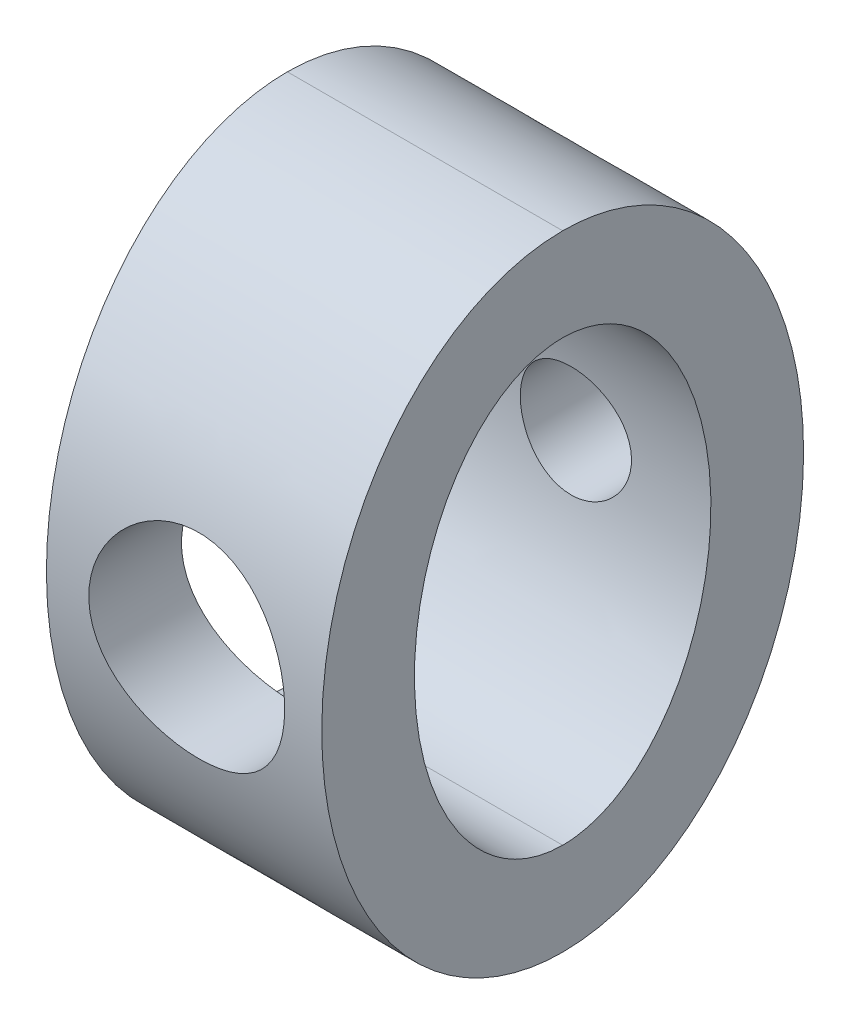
ISO-10303-21;
HEADER;
FILE_DESCRIPTION(('STEP AP214'),'2;1');
FILE_NAME('part.step','',(''),(''),'','','');
FILE_SCHEMA(('AUTOMOTIVE_DESIGN { 1 0 10303 214 1 1 1 1 }'));
ENDSEC;
DATA;
#1=APPLICATION_CONTEXT('core data for automotive mechanical design processes');
#2=APPLICATION_PROTOCOL_DEFINITION('international standard','automotive_design',2000,#1);
#3=PRODUCT_CONTEXT('',#1,'mechanical');
#4=PRODUCT('Part','Part','',(#3));
#5=PRODUCT_RELATED_PRODUCT_CATEGORY('part','',(#4));
#6=PRODUCT_DEFINITION_FORMATION('','',#4);
#7=PRODUCT_DEFINITION_CONTEXT('part definition',#1,'design');
#8=PRODUCT_DEFINITION('design','',#6,#7);
#9=PRODUCT_DEFINITION_SHAPE('','',#8);
#10=(LENGTH_UNIT() NAMED_UNIT(*) SI_UNIT(.MILLI.,.METRE.));
#11=(NAMED_UNIT(*) PLANE_ANGLE_UNIT() SI_UNIT($,.RADIAN.));
#12=(NAMED_UNIT(*) SI_UNIT($,.STERADIAN.) SOLID_ANGLE_UNIT());
#13=UNCERTAINTY_MEASURE_WITH_UNIT(LENGTH_MEASURE(1.E-05),#10,'distance_accuracy_value','');
#14=(GEOMETRIC_REPRESENTATION_CONTEXT(3) GLOBAL_UNCERTAINTY_ASSIGNED_CONTEXT((#13)) GLOBAL_UNIT_ASSIGNED_CONTEXT((#10,
#11,#12)) REPRESENTATION_CONTEXT('',''));
#15=CARTESIAN_POINT('',(0.,0.,0.));
#16=DIRECTION('',(0.,0.,1.));
#17=DIRECTION('',(1.,0.,0.));
#18=AXIS2_PLACEMENT_3D('',#15,#16,#17);
#19=CARTESIAN_POINT('',(6.604,10.541,11.557));
#20=CARTESIAN_POINT('',(-6.604,10.541,11.557));
#21=CARTESIAN_POINT('',(6.60399999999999,10.541,25.781));
#22=CARTESIAN_POINT('',(-6.604,10.541,25.781));
#23=CARTESIAN_POINT('',(6.60399999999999,-10.541,25.781));
#24=CARTESIAN_POINT('',(-6.604,-10.541,25.781));
#25=CARTESIAN_POINT('',(6.604,-10.541,11.557));
#26=CARTESIAN_POINT('',(-6.604,-10.541,11.557));
#27=(BOUNDED_SURFACE() B_SPLINE_SURFACE(3,1,((#19,#20),(#21,#22),(#23,#24),(#25,#26)),
.UNSPECIFIED.,.F.,.F.,.F.) B_SPLINE_SURFACE_WITH_KNOTS((4,4),(2,2),(0.,1.),(0.,1.),
.UNSPECIFIED.) GEOMETRIC_REPRESENTATION_ITEM() RATIONAL_B_SPLINE_SURFACE(((1.,1.),
(0.333333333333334,0.333333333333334),(0.333333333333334,0.333333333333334),(1.,1.))) REPRESENTATION_ITEM('') SURFACE());
#28=CARTESIAN_POINT('',(0.126999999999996,-4.699,17.923242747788));
#29=CARTESIAN_POINT('',(0.255315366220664,-4.69899976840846,17.9232429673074));
#30=CARTESIAN_POINT('',(0.383635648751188,-4.69373953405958,17.925014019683));
#31=CARTESIAN_POINT('',(0.63936772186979,-4.67274528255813,17.9320385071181));
#32=CARTESIAN_POINT('',(0.76677913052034,-4.6570070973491,17.9372933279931));
#33=CARTESIAN_POINT('',(1.01988542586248,-4.61517405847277,17.9511155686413));
#34=CARTESIAN_POINT('',(1.14557773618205,-4.58906511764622,17.9596874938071));
#35=CARTESIAN_POINT('',(1.39422326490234,-4.52671887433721,17.9798593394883));
#36=CARTESIAN_POINT('',(1.51717538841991,-4.49047759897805,17.9914604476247));
#37=CARTESIAN_POINT('',(1.75911507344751,-4.408295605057,18.0172772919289));
#38=CARTESIAN_POINT('',(1.87811306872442,-4.36238322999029,18.0314853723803));
#39=CARTESIAN_POINT('',(2.11176779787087,-4.26116581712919,18.0620979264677));
#40=CARTESIAN_POINT('',(2.22642289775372,-4.20585728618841,18.0785032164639));
#41=CARTESIAN_POINT('',(2.5626652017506,-4.02647955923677,18.1302789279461));
#42=CARTESIAN_POINT('',(2.77681435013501,-3.88886086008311,18.1682414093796));
#43=CARTESIAN_POINT('',(3.18634849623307,-3.5762538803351,18.2481568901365));
#44=CARTESIAN_POINT('',(3.38088928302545,-3.40018935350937,18.2901998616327));
#45=CARTESIAN_POINT('',(3.73824674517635,-3.01793430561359,18.3726257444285));
#46=CARTESIAN_POINT('',(3.90105820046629,-2.81173883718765,18.4130083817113));
#47=CARTESIAN_POINT('',(4.19348213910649,-2.36980147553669,18.4886787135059));
#48=CARTESIAN_POINT('',(4.32233875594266,-2.1335369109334,18.523843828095));
#49=CARTESIAN_POINT('',(4.53817871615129,-1.64141487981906,18.5842690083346));
#50=CARTESIAN_POINT('',(4.62517127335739,-1.3855617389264,18.6095312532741));
#51=CARTESIAN_POINT('',(4.75218612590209,-0.869836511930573,18.6468373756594));
#52=CARTESIAN_POINT('',(4.79356067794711,-0.610325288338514,18.6592610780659));
#53=CARTESIAN_POINT('',(4.83247611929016,-0.0877651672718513,18.6709386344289));
#54=CARTESIAN_POINT('',(4.83002601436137,0.175282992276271,18.6701951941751));
#55=CARTESIAN_POINT('',(4.7821782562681,0.688709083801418,18.6558557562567));
#56=CARTESIAN_POINT('',(4.73812921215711,0.939225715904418,18.6426633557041));
#57=CARTESIAN_POINT('',(4.61055832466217,1.42912024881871,18.6052967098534));
#58=CARTESIAN_POINT('',(4.52703441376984,1.66849756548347,18.5811218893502));
#59=CARTESIAN_POINT('',(4.3220551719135,2.13240326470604,18.5237933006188));
#60=CARTESIAN_POINT('',(4.20019342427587,2.35673974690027,18.4905438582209));
#61=CARTESIAN_POINT('',(3.92234856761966,2.78217559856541,18.4184030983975));
#62=CARTESIAN_POINT('',(3.76635916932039,2.98327067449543,18.3795107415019));
#63=CARTESIAN_POINT('',(3.41765729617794,3.36475062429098,18.2983417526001));
#64=CARTESIAN_POINT('',(3.22375894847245,3.54403531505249,18.2559924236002));
#65=CARTESIAN_POINT('',(2.80811259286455,3.86802272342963,18.1739044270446));
#66=CARTESIAN_POINT('',(2.5863507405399,4.01270814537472,18.1341670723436));
#67=CARTESIAN_POINT('',(2.23582890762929,4.20136260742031,18.0798404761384));
#68=CARTESIAN_POINT('',(2.11508517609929,4.25983012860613,18.0625076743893));
#69=CARTESIAN_POINT('',(1.86878024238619,4.36632243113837,18.0302880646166));
#70=CARTESIAN_POINT('',(1.74322105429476,4.41435152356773,18.0154002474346));
#71=CARTESIAN_POINT('',(1.48838244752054,4.49947377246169,17.9886040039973));
#72=CARTESIAN_POINT('',(1.35910961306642,4.53658511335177,17.9766906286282));
#73=CARTESIAN_POINT('',(1.09765549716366,4.59961923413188,17.9562401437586));
#74=CARTESIAN_POINT('',(0.965475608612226,4.62554725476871,17.9477014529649));
#75=CARTESIAN_POINT('',(0.715769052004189,4.66346000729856,17.9351417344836));
#76=CARTESIAN_POINT('',(0.598464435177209,4.6767777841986,17.9306909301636));
#77=CARTESIAN_POINT('',(0.363107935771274,4.69454791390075,17.9247413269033));
#78=CARTESIAN_POINT('',(0.245056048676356,4.69900021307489,17.9232425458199));
#79=CARTESIAN_POINT('',(-0.00131536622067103,4.69899976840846,17.9232429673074));
#80=CARTESIAN_POINT('',(-0.129635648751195,4.69373953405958,17.925014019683));
#81=CARTESIAN_POINT('',(-0.385367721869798,4.67274528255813,17.9320385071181));
#82=CARTESIAN_POINT('',(-0.512779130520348,4.65700709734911,17.9372933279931));
#83=CARTESIAN_POINT('',(-0.765885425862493,4.61517405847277,17.9511155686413));
#84=CARTESIAN_POINT('',(-0.891577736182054,4.58906511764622,17.9596874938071));
#85=CARTESIAN_POINT('',(-1.14022326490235,4.52671887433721,17.9798593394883));
#86=CARTESIAN_POINT('',(-1.26317538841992,4.49047759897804,17.9914604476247));
#87=CARTESIAN_POINT('',(-1.50511507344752,4.408295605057,18.0172772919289));
#88=CARTESIAN_POINT('',(-1.62411306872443,4.36238322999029,18.0314853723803));
#89=CARTESIAN_POINT('',(-1.85776779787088,4.26116581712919,18.0620979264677));
#90=CARTESIAN_POINT('',(-1.97242289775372,4.20585728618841,18.0785032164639));
#91=CARTESIAN_POINT('',(-2.30866520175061,4.02647955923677,18.1302789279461));
#92=CARTESIAN_POINT('',(-2.52281435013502,3.88886086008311,18.1682414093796));
#93=CARTESIAN_POINT('',(-2.93234849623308,3.5762538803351,18.2481568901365));
#94=CARTESIAN_POINT('',(-3.12688928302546,3.40018935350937,18.2901998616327));
#95=CARTESIAN_POINT('',(-3.48424674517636,3.01793430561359,18.3726257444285));
#96=CARTESIAN_POINT('',(-3.64705820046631,2.81173883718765,18.4130083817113));
#97=CARTESIAN_POINT('',(-3.93948213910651,2.36980147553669,18.4886787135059));
#98=CARTESIAN_POINT('',(-4.06833875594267,2.13353691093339,18.523843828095));
#99=CARTESIAN_POINT('',(-4.2841787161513,1.64141487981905,18.5842690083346));
#100=CARTESIAN_POINT('',(-4.37117127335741,1.3855617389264,18.6095312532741));
#101=CARTESIAN_POINT('',(-4.49818612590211,0.869836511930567,18.6468373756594));
#102=CARTESIAN_POINT('',(-4.53956067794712,0.610325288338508,18.6592610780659));
#103=CARTESIAN_POINT('',(-4.57847611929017,0.0877651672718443,18.6709386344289));
#104=CARTESIAN_POINT('',(-4.57602601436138,-0.175282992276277,18.6701951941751));
#105=CARTESIAN_POINT('',(-4.52817825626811,-0.688709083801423,18.6558557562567));
#106=CARTESIAN_POINT('',(-4.48412921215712,-0.939225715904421,18.6426633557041));
#107=CARTESIAN_POINT('',(-4.35655832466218,-1.42912024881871,18.6052967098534));
#108=CARTESIAN_POINT('',(-4.27303441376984,-1.66849756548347,18.5811218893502));
#109=CARTESIAN_POINT('',(-4.06805517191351,-2.13240326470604,18.5237933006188));
#110=CARTESIAN_POINT('',(-3.94619342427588,-2.35673974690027,18.4905438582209));
#111=CARTESIAN_POINT('',(-3.66834856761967,-2.78217559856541,18.4184030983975));
#112=CARTESIAN_POINT('',(-3.51235916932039,-2.98327067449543,18.3795107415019));
#113=CARTESIAN_POINT('',(-3.16365729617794,-3.36475062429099,18.2983417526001));
#114=CARTESIAN_POINT('',(-2.96975894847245,-3.54403531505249,18.2559924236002));
#115=CARTESIAN_POINT('',(-2.55411259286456,-3.86802272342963,18.1739044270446));
#116=CARTESIAN_POINT('',(-2.33235074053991,-4.01270814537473,18.1341670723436));
#117=CARTESIAN_POINT('',(-1.9818289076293,-4.20136260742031,18.0798404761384));
#118=CARTESIAN_POINT('',(-1.86108517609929,-4.25983012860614,18.0625076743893));
#119=CARTESIAN_POINT('',(-1.61478024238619,-4.36632243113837,18.0302880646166));
#120=CARTESIAN_POINT('',(-1.48922105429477,-4.41435152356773,18.0154002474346));
#121=CARTESIAN_POINT('',(-1.23438244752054,-4.49947377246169,17.9886040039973));
#122=CARTESIAN_POINT('',(-1.10510961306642,-4.53658511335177,17.9766906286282));
#123=CARTESIAN_POINT('',(-0.843655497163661,-4.59961923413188,17.9562401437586));
#124=CARTESIAN_POINT('',(-0.71147560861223,-4.62554725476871,17.9477014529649));
#125=CARTESIAN_POINT('',(-0.461769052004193,-4.66346000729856,17.9351417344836));
#126=CARTESIAN_POINT('',(-0.344464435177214,-4.6767777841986,17.9306909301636));
#127=CARTESIAN_POINT('',(-0.10910793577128,-4.69454791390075,17.9247413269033));
#128=CARTESIAN_POINT('',(0.00894395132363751,-4.69900021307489,17.9232425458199));
#129=CARTESIAN_POINT('',(0.126999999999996,-4.699,17.923242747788));
#130=B_SPLINE_CURVE_WITH_KNOTS('',3,(#28,#29,#30,#31,#32,#33,#34,#35,#36,#37,#38,#39,#40,#41,
#42,#43,#44,#45,#46,#47,#48,#49,#50,#51,#52,#53,#54,#55,#56,#57,#58,#59,#60,#61,#62,#63,#64,#65,
#66,#67,#68,#69,#70,#71,#72,#73,#74,#75,#76,#77,#78,#79,#80,#81,#82,#83,#84,#85,#86,#87,#88,#89,
#90,#91,#92,#93,#94,#95,#96,#97,#98,#99,#100,#101,#102,#103,#104,#105,#106,#107,#108,#109,#110,
#111,#112,#113,#114,#115,#116,#117,#118,#119,#120,#121,#122,#123,#124,#125,#126,#127,#128,#129),
.UNSPECIFIED.,.T.,.F.,(4,2,2,2,2,2,2,2,2,2,2,2,2,2,2,2,2,2,2,2,2,2,2,2,2,2,2,2,2,2,2,2,2,2,2,2,
2,2,2,2,2,2,2,2,2,2,2,2,2,2,4),(0.,0.384835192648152,0.769823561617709,1.1553366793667,
1.54100116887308,1.92555072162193,2.31024354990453,3.07873154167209,3.87238743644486,
4.6661737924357,5.4763693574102,6.2863865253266,7.07168672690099,7.85682555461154,
8.61735400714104,9.37792229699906,10.146841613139,10.9159027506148,11.7146739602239,
12.5138436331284,12.919231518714,13.3244516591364,13.7289930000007,14.1333445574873,
14.4874085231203,14.841474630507,15.2263098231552,15.6112981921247,15.9968113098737,
16.3824757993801,16.7670253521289,17.1517181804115,17.9202061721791,18.7138620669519,
19.5076484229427,20.3178439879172,21.1278611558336,21.913161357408,22.6983001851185,
23.458828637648,24.2193969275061,24.988316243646,25.7573773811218,26.5561485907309,
27.3553182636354,27.7607061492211,28.1659262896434,28.5704676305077,28.9748191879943,
29.3288831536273,29.682949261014),.UNSPECIFIED.);
#131=CARTESIAN_POINT('',(0.126999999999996,-4.699,17.923242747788));
#132=VERTEX_POINT('',#131);
#133=EDGE_CURVE('E20',#132,#132,#130,.T.);
#134=DIRECTION('',(1.,0.,0.));
#135=VECTOR('',#134,1.);
#136=CARTESIAN_POINT('',(0.,-10.541,11.557));
#137=LINE('',#136,#135);
#138=CARTESIAN_POINT('',(-6.604,-10.541,11.557));
#139=VERTEX_POINT('',#138);
#140=CARTESIAN_POINT('',(6.604,-10.541,11.557));
#141=VERTEX_POINT('',#140);
#142=EDGE_CURVE('E73',#139,#141,#137,.T.);
#143=CARTESIAN_POINT('',(-6.604,-10.541,11.557));
#144=CARTESIAN_POINT('',(-6.604,-10.5410014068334,11.6293544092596));
#145=CARTESIAN_POINT('',(-6.604,-10.5393630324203,11.7016986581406));
#146=CARTESIAN_POINT('',(-6.604,-10.5328242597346,11.8462363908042));
#147=CARTESIAN_POINT('',(-6.604,-10.5279240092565,11.9184298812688));
#148=CARTESIAN_POINT('',(-6.604,-10.5083686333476,12.1344646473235));
#149=CARTESIAN_POINT('',(-6.604,-10.4888588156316,12.277894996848));
#150=CARTESIAN_POINT('',(-6.604,-10.437492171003,12.5613509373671));
#151=CARTESIAN_POINT('',(-6.604,-10.405731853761,12.7013942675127));
#152=CARTESIAN_POINT('',(-6.604,-10.3304684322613,12.978300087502));
#153=CARTESIAN_POINT('',(-6.604,-10.2869637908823,13.1151621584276));
#154=CARTESIAN_POINT('',(-6.604,-10.1891189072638,13.3845058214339));
#155=CARTESIAN_POINT('',(-6.604,-10.1348098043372,13.5169987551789));
#156=CARTESIAN_POINT('',(-6.604,-10.0161383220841,13.7774130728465));
#157=CARTESIAN_POINT('',(-6.604,-9.95177254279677,13.9053328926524));
#158=CARTESIAN_POINT('',(-6.604,-9.74468126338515,14.2819229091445));
#159=CARTESIAN_POINT('',(-6.604,-9.5880819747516,14.5231016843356));
#160=CARTESIAN_POINT('',(-6.604,-9.28851690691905,14.9249434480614));
#161=CARTESIAN_POINT('',(-6.604,-9.15204890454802,15.0905876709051));
#162=CARTESIAN_POINT('',(-6.604,-8.8650587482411,15.4092706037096));
#163=CARTESIAN_POINT('',(-6.604,-8.71453433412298,15.5623072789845));
#164=CARTESIAN_POINT('',(-6.604,-8.40146551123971,15.8560611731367));
#165=CARTESIAN_POINT('',(-6.604,-8.23889976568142,15.9967555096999));
#166=CARTESIAN_POINT('',(-6.604,-7.90392314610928,16.26582161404));
#167=CARTESIAN_POINT('',(-6.604,-7.73151219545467,16.3941932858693));
#168=CARTESIAN_POINT('',(-6.604,-7.3001559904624,16.6933132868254));
#169=CARTESIAN_POINT('',(-6.604,-7.03673108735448,16.8576205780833));
#170=CARTESIAN_POINT('',(-6.604,-6.49659558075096,17.1627303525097));
#171=CARTESIAN_POINT('',(-6.604,-6.21987938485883,17.3035228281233));
#172=CARTESIAN_POINT('',(-6.604,-5.65594035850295,17.5629406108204));
#173=CARTESIAN_POINT('',(-6.604,-5.36870688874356,17.6815426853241));
#174=CARTESIAN_POINT('',(-6.604,-4.78642678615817,17.8974875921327));
#175=CARTESIAN_POINT('',(-6.604,-4.49138031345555,17.9948308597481));
#176=CARTESIAN_POINT('',(-6.604,-3.79275592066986,18.1992165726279));
#177=CARTESIAN_POINT('',(-6.604,-3.3867686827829,18.2980697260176));
#178=CARTESIAN_POINT('',(-6.604,-2.56779644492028,18.4607668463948));
#179=CARTESIAN_POINT('',(-6.604,-2.15480914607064,18.524599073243));
#180=CARTESIAN_POINT('',(-6.604,-1.32445315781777,18.6183579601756));
#181=CARTESIAN_POINT('',(-6.604,-0.907079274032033,18.6482383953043));
#182=CARTESIAN_POINT('',(-6.604,-0.0713460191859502,18.6744345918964));
#183=CARTESIAN_POINT('',(-6.604,0.347013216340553,18.6707547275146));
#184=CARTESIAN_POINT('',(-6.604,1.18714462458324,18.6295332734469));
#185=CARTESIAN_POINT('',(-6.604,1.60889695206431,18.5915830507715));
#186=CARTESIAN_POINT('',(-6.604,2.44789754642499,18.4805823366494));
#187=CARTESIAN_POINT('',(-6.604,2.86514476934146,18.4075238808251));
#188=CARTESIAN_POINT('',(-6.604,3.69077183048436,18.2252359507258));
#189=CARTESIAN_POINT('',(-6.604,4.09916872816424,18.1160841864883));
#190=CARTESIAN_POINT('',(-6.604,4.90374577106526,17.8597040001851));
#191=CARTESIAN_POINT('',(-6.604,5.29993373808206,17.712500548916));
#192=CARTESIAN_POINT('',(-6.604,5.91771320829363,17.4453919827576));
#193=CARTESIAN_POINT('',(-6.604,6.14501776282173,17.3385847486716));
#194=CARTESIAN_POINT('',(-6.604,6.59192807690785,17.1099721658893));
#195=CARTESIAN_POINT('',(-6.604,6.81153588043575,16.9881708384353));
#196=CARTESIAN_POINT('',(-6.604,7.24114848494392,16.728968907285));
#197=CARTESIAN_POINT('',(-6.604,7.45116155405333,16.5915821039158));
#198=CARTESIAN_POINT('',(-6.604,7.85947869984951,16.3005475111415));
#199=CARTESIAN_POINT('',(-6.604,8.05778567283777,16.1469037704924));
#200=CARTESIAN_POINT('',(-6.604,8.53920119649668,15.7385901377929));
#201=CARTESIAN_POINT('',(-6.604,8.81317034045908,15.4727457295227));
#202=CARTESIAN_POINT('',(-6.604,9.18998939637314,15.0444393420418));
#203=CARTESIAN_POINT('',(-6.604,9.30989444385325,14.8967665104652));
#204=CARTESIAN_POINT('',(-6.604,9.53660034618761,14.5916325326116));
#205=CARTESIAN_POINT('',(-6.604,9.64340461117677,14.4341739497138));
#206=CARTESIAN_POINT('',(-6.604,9.82087033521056,14.1442922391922));
#207=CARTESIAN_POINT('',(-6.604,9.89439819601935,14.0136185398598));
#208=CARTESIAN_POINT('',(-6.604,10.0310122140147,13.7469328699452));
#209=CARTESIAN_POINT('',(-6.604,10.0941008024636,13.6109221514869));
#210=CARTESIAN_POINT('',(-6.604,10.2087282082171,13.3343844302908));
#211=CARTESIAN_POINT('',(-6.604,10.2602876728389,13.1938660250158));
#212=CARTESIAN_POINT('',(-6.604,10.3510486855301,12.9089458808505));
#213=CARTESIAN_POINT('',(-6.604,10.3902543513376,12.7645454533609));
#214=CARTESIAN_POINT('',(-6.604,10.4618117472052,12.4446950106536));
#215=CARTESIAN_POINT('',(-6.604,10.4913997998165,12.2686093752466));
#216=CARTESIAN_POINT('',(-6.604,10.5211008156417,12.0027896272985));
#217=CARTESIAN_POINT('',(-6.604,10.5285543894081,11.9138185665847));
#218=CARTESIAN_POINT('',(-6.604,10.5385061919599,11.7355720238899));
#219=CARTESIAN_POINT('',(-6.604,10.5410028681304,11.6462964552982));
#220=CARTESIAN_POINT('',(-6.604,10.541,11.557));
#221=B_SPLINE_CURVE_WITH_KNOTS('',3,(#143,#144,#145,#146,#147,#148,#149,#150,#151,#152,#153,
#154,#155,#156,#157,#158,#159,#160,#161,#162,#163,#164,#165,#166,#167,#168,#169,#170,#171,#172,
#173,#174,#175,#176,#177,#178,#179,#180,#181,#182,#183,#184,#185,#186,#187,#188,#189,#190,#191,
#192,#193,#194,#195,#196,#197,#198,#199,#200,#201,#202,#203,#204,#205,#206,#207,#208,#209,#210,
#211,#212,#213,#214,#215,#216,#217,#218,#219,#220),.UNSPECIFIED.,.F.,.F.,(4,2,2,2,2,2,2,2,2,2,2,
2,2,2,2,2,2,2,2,2,2,2,2,2,2,2,2,2,2,2,2,2,2,2,2,2,2,2,4),(0.,0.217024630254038,
0.434039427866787,0.867666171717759,1.29794435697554,1.72827888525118,2.15739066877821,
2.58664784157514,3.44618300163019,4.08926359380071,4.73244776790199,5.37680023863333,
6.02115772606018,6.95115586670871,7.88154879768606,8.81291043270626,9.74425299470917,
10.9960846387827,12.2483356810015,13.5022896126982,14.7560801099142,16.0250208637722,
17.2942496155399,18.5607632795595,19.8264479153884,20.5794110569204,21.3321727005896,
22.0842729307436,22.8361862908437,23.9766921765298,24.5468099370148,25.1167789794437,
25.5661865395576,26.0154892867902,26.4639808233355,26.9123227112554,27.4467962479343,
27.7145258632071,27.9823393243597),.UNSPECIFIED.);
#222=CARTESIAN_POINT('',(-6.604,10.541,11.557));
#223=VERTEX_POINT('',#222);
#224=EDGE_CURVE('E58',#139,#223,#221,.T.);
#225=DIRECTION('',(-1.,0.,0.));
#226=VECTOR('',#225,1.);
#227=CARTESIAN_POINT('',(0.,10.541,11.557));
#228=LINE('',#227,#226);
#229=CARTESIAN_POINT('',(6.604,10.541,11.557));
#230=VERTEX_POINT('',#229);
#231=EDGE_CURVE('E64',#230,#223,#228,.T.);
#232=CARTESIAN_POINT('',(6.604,-10.541,11.557));
#233=CARTESIAN_POINT('',(6.604,-10.5410014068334,11.6293544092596));
#234=CARTESIAN_POINT('',(6.604,-10.5393630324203,11.7016986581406));
#235=CARTESIAN_POINT('',(6.604,-10.5328242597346,11.8462363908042));
#236=CARTESIAN_POINT('',(6.604,-10.5279240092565,11.9184298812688));
#237=CARTESIAN_POINT('',(6.604,-10.5083686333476,12.1344646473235));
#238=CARTESIAN_POINT('',(6.604,-10.4888588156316,12.277894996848));
#239=CARTESIAN_POINT('',(6.604,-10.437492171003,12.5613509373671));
#240=CARTESIAN_POINT('',(6.604,-10.405731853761,12.7013942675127));
#241=CARTESIAN_POINT('',(6.604,-10.3304684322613,12.978300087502));
#242=CARTESIAN_POINT('',(6.604,-10.2869637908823,13.1151621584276));
#243=CARTESIAN_POINT('',(6.604,-10.1891189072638,13.3845058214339));
#244=CARTESIAN_POINT('',(6.604,-10.1348098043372,13.5169987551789));
#245=CARTESIAN_POINT('',(6.604,-10.0161383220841,13.7774130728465));
#246=CARTESIAN_POINT('',(6.604,-9.95177254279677,13.9053328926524));
#247=CARTESIAN_POINT('',(6.604,-9.74468126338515,14.2819229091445));
#248=CARTESIAN_POINT('',(6.604,-9.5880819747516,14.5231016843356));
#249=CARTESIAN_POINT('',(6.604,-9.28851690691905,14.9249434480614));
#250=CARTESIAN_POINT('',(6.604,-9.15204890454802,15.0905876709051));
#251=CARTESIAN_POINT('',(6.604,-8.8650587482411,15.4092706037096));
#252=CARTESIAN_POINT('',(6.604,-8.71453433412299,15.5623072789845));
#253=CARTESIAN_POINT('',(6.604,-8.40146551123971,15.8560611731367));
#254=CARTESIAN_POINT('',(6.604,-8.23889976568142,15.9967555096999));
#255=CARTESIAN_POINT('',(6.604,-7.90392314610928,16.26582161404));
#256=CARTESIAN_POINT('',(6.604,-7.73151219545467,16.3941932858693));
#257=CARTESIAN_POINT('',(6.604,-7.3001559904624,16.6933132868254));
#258=CARTESIAN_POINT('',(6.604,-7.03673108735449,16.8576205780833));
#259=CARTESIAN_POINT('',(6.604,-6.49659558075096,17.1627303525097));
#260=CARTESIAN_POINT('',(6.604,-6.21987938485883,17.3035228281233));
#261=CARTESIAN_POINT('',(6.604,-5.65594035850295,17.5629406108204));
#262=CARTESIAN_POINT('',(6.604,-5.36870688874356,17.6815426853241));
#263=CARTESIAN_POINT('',(6.604,-4.78642678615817,17.8974875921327));
#264=CARTESIAN_POINT('',(6.604,-4.49138031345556,17.9948308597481));
#265=CARTESIAN_POINT('',(6.604,-3.79275592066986,18.1992165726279));
#266=CARTESIAN_POINT('',(6.604,-3.3867686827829,18.2980697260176));
#267=CARTESIAN_POINT('',(6.604,-2.56779644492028,18.4607668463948));
#268=CARTESIAN_POINT('',(6.604,-2.15480914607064,18.524599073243));
#269=CARTESIAN_POINT('',(6.604,-1.32445315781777,18.6183579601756));
#270=CARTESIAN_POINT('',(6.604,-0.907079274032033,18.6482383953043));
#271=CARTESIAN_POINT('',(6.604,-0.0713460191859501,18.6744345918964));
#272=CARTESIAN_POINT('',(6.604,0.347013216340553,18.6707547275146));
#273=CARTESIAN_POINT('',(6.604,1.18714462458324,18.6295332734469));
#274=CARTESIAN_POINT('',(6.604,1.60889695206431,18.5915830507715));
#275=CARTESIAN_POINT('',(6.604,2.44789754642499,18.4805823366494));
#276=CARTESIAN_POINT('',(6.604,2.86514476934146,18.4075238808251));
#277=CARTESIAN_POINT('',(6.604,3.69077183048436,18.2252359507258));
#278=CARTESIAN_POINT('',(6.604,4.09916872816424,18.1160841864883));
#279=CARTESIAN_POINT('',(6.604,4.90374577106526,17.8597040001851));
#280=CARTESIAN_POINT('',(6.604,5.29993373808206,17.712500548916));
#281=CARTESIAN_POINT('',(6.604,5.91771320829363,17.4453919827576));
#282=CARTESIAN_POINT('',(6.604,6.14501776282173,17.3385847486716));
#283=CARTESIAN_POINT('',(6.604,6.59192807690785,17.1099721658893));
#284=CARTESIAN_POINT('',(6.604,6.81153588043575,16.9881708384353));
#285=CARTESIAN_POINT('',(6.604,7.24114848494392,16.728968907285));
#286=CARTESIAN_POINT('',(6.604,7.45116155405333,16.5915821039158));
#287=CARTESIAN_POINT('',(6.604,7.85947869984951,16.3005475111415));
#288=CARTESIAN_POINT('',(6.604,8.05778567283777,16.1469037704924));
#289=CARTESIAN_POINT('',(6.604,8.53920119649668,15.7385901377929));
#290=CARTESIAN_POINT('',(6.604,8.81317034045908,15.4727457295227));
#291=CARTESIAN_POINT('',(6.604,9.18998939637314,15.0444393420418));
#292=CARTESIAN_POINT('',(6.604,9.30989444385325,14.8967665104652));
#293=CARTESIAN_POINT('',(6.604,9.53660034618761,14.5916325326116));
#294=CARTESIAN_POINT('',(6.604,9.64340461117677,14.4341739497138));
#295=CARTESIAN_POINT('',(6.604,9.82087033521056,14.1442922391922));
#296=CARTESIAN_POINT('',(6.604,9.89439819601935,14.0136185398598));
#297=CARTESIAN_POINT('',(6.604,10.0310122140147,13.7469328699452));
#298=CARTESIAN_POINT('',(6.604,10.0941008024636,13.6109221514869));
#299=CARTESIAN_POINT('',(6.604,10.2087282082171,13.3343844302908));
#300=CARTESIAN_POINT('',(6.604,10.2602876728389,13.1938660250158));
#301=CARTESIAN_POINT('',(6.604,10.3510486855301,12.9089458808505));
#302=CARTESIAN_POINT('',(6.604,10.3902543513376,12.7645454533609));
#303=CARTESIAN_POINT('',(6.604,10.4618117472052,12.4446950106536));
#304=CARTESIAN_POINT('',(6.604,10.4913997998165,12.2686093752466));
#305=CARTESIAN_POINT('',(6.604,10.5211008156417,12.0027896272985));
#306=CARTESIAN_POINT('',(6.604,10.5285543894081,11.9138185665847));
#307=CARTESIAN_POINT('',(6.604,10.5385061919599,11.7355720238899));
#308=CARTESIAN_POINT('',(6.604,10.5410028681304,11.6462964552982));
#309=CARTESIAN_POINT('',(6.604,10.541,11.557));
#310=B_SPLINE_CURVE_WITH_KNOTS('',3,(#232,#233,#234,#235,#236,#237,#238,#239,#240,#241,#242,
#243,#244,#245,#246,#247,#248,#249,#250,#251,#252,#253,#254,#255,#256,#257,#258,#259,#260,#261,
#262,#263,#264,#265,#266,#267,#268,#269,#270,#271,#272,#273,#274,#275,#276,#277,#278,#279,#280,
#281,#282,#283,#284,#285,#286,#287,#288,#289,#290,#291,#292,#293,#294,#295,#296,#297,#298,#299,
#300,#301,#302,#303,#304,#305,#306,#307,#308,#309),.UNSPECIFIED.,.F.,.F.,(4,2,2,2,2,2,2,2,2,2,2,
2,2,2,2,2,2,2,2,2,2,2,2,2,2,2,2,2,2,2,2,2,2,2,2,2,2,2,4),(0.,0.217024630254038,
0.434039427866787,0.867666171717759,1.29794435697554,1.72827888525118,2.15739066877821,
2.58664784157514,3.44618300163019,4.08926359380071,4.73244776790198,5.37680023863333,
6.02115772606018,6.95115586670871,7.88154879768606,8.81291043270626,9.74425299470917,
10.9960846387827,12.2483356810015,13.5022896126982,14.7560801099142,16.0250208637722,
17.2942496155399,18.5607632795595,19.8264479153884,20.5794110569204,21.3321727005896,
22.0842729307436,22.8361862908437,23.9766921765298,24.5468099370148,25.1167789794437,
25.5661865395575,26.0154892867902,26.4639808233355,26.9123227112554,27.4467962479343,
27.7145258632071,27.9823393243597),.UNSPECIFIED.);
#311=EDGE_CURVE('E178',#141,#230,#310,.T.);
#312=ORIENTED_EDGE('',*,*,#133,.T.);
#313=EDGE_LOOP('',(#312));
#314=FACE_BOUND('',#313,.T.);
#315=ORIENTED_EDGE('',*,*,#142,.F.);
#316=ORIENTED_EDGE('',*,*,#224,.T.);
#317=ORIENTED_EDGE('',*,*,#231,.F.);
#318=ORIENTED_EDGE('',*,*,#311,.F.);
#319=EDGE_LOOP('',(#315,#316,#317,#318));
#320=FACE_BOUND('',#319,.T.);
#321=ADVANCED_FACE('F14',(#314,#320),#27,.T.);
#322=CARTESIAN_POINT('',(0.126999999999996,0.,31.623));
#323=DIRECTION('',(0.,0.,-1.));
#324=DIRECTION('',(0.,1.,0.));
#325=AXIS2_PLACEMENT_3D('',#322,#323,#324);
#326=CYLINDRICAL_SURFACE('',#325,4.699);
#327=CARTESIAN_POINT('',(0.127000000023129,-4.699,22.5311644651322));
#328=CARTESIAN_POINT('',(0.256725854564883,-4.6989994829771,22.5311648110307));
#329=CARTESIAN_POINT('',(0.38646385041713,-4.6936233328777,22.532536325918));
#330=CARTESIAN_POINT('',(0.645042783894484,-4.67215946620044,22.5379812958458));
#331=CARTESIAN_POINT('',(0.773883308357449,-4.65606710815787,22.5420559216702));
#332=CARTESIAN_POINT('',(1.02987907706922,-4.61327162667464,22.5527889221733));
#333=CARTESIAN_POINT('',(1.15703152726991,-4.5865527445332,22.5594511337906));
#334=CARTESIAN_POINT('',(1.40859592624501,-4.52271629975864,22.5751561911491));
#335=CARTESIAN_POINT('',(1.5330068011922,-4.48559473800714,22.5841999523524));
#336=CARTESIAN_POINT('',(1.77791697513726,-4.40134068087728,22.604372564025));
#337=CARTESIAN_POINT('',(1.89842424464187,-4.35423029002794,22.6154968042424));
#338=CARTESIAN_POINT('',(2.13501701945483,-4.25031663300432,22.6395137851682));
#339=CARTESIAN_POINT('',(2.25110086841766,-4.19350977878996,22.6524071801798));
#340=CARTESIAN_POINT('',(2.59140030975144,-4.00920500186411,22.6931785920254));
#341=CARTESIAN_POINT('',(2.80798722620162,-3.86771105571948,22.7231759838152));
#342=CARTESIAN_POINT('',(3.21873292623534,-3.54836168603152,22.786092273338));
#343=CARTESIAN_POINT('',(3.41237204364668,-3.36985105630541,22.8190567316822));
#344=CARTESIAN_POINT('',(3.76732304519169,-2.98287682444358,22.8837778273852));
#345=CARTESIAN_POINT('',(3.92863043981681,-2.77440906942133,22.9155342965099));
#346=CARTESIAN_POINT('',(4.21626878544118,-2.3301109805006,22.9747840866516));
#347=CARTESIAN_POINT('',(4.34211960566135,-2.09396118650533,23.0022168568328));
#348=CARTESIAN_POINT('',(4.55215284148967,-1.60307763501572,23.0492675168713));
#349=CARTESIAN_POINT('',(4.63634130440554,-1.34834658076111,23.0688865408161));
#350=CARTESIAN_POINT('',(4.75905288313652,-0.832786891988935,23.0978287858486));
#351=CARTESIAN_POINT('',(4.79843107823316,-0.572172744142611,23.1073445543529));
#352=CARTESIAN_POINT('',(4.83309237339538,-0.0478739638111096,23.1157088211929));
#353=CARTESIAN_POINT('',(4.82838147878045,0.215810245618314,23.1145587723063));
#354=CARTESIAN_POINT('',(4.77560055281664,0.733014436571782,23.1018566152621));
#355=CARTESIAN_POINT('',(4.72842597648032,0.986631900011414,23.0905193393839));
#356=CARTESIAN_POINT('',(4.59348769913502,1.48224346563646,23.0589298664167));
#357=CARTESIAN_POINT('',(4.50572181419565,1.72423694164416,23.038677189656));
#358=CARTESIAN_POINT('',(4.29139815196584,2.19207647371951,22.9911545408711));
#359=CARTESIAN_POINT('',(4.16451879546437,2.41776877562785,22.9638267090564));
#360=CARTESIAN_POINT('',(3.87570113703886,2.84504255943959,22.9050560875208));
#361=CARTESIAN_POINT('',(3.71375936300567,3.04662165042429,22.8736128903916));
#362=CARTESIAN_POINT('',(3.44575617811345,3.32925889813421,22.8254544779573));
#363=CARTESIAN_POINT('',(3.35087166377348,3.42121504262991,22.8090214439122));
#364=CARTESIAN_POINT('',(3.15368693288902,3.59682750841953,22.7764021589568));
#365=CARTESIAN_POINT('',(3.05138934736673,3.6804867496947,22.7602158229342));
#366=CARTESIAN_POINT('',(2.83995990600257,3.83900109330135,22.728534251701));
#367=CARTESIAN_POINT('',(2.73082242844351,3.91384880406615,22.7130396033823));
#368=CARTESIAN_POINT('',(2.50655046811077,4.05411195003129,22.6832097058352));
#369=CARTESIAN_POINT('',(2.39141831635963,4.1195310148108,22.6688740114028));
#370=CARTESIAN_POINT('',(2.15517807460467,4.24085300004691,22.6416986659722));
#371=CARTESIAN_POINT('',(2.03403791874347,4.2966956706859,22.6288686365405));
#372=CARTESIAN_POINT('',(1.7873277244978,4.39791797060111,22.6052063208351));
#373=CARTESIAN_POINT('',(1.66175947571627,4.44330177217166,22.5943732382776));
#374=CARTESIAN_POINT('',(1.40726441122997,4.52319389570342,22.5750566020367));
#375=CARTESIAN_POINT('',(1.27834353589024,4.55772020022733,22.5665691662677));
#376=CARTESIAN_POINT('',(1.01794532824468,4.61569029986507,22.5521967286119));
#377=CARTESIAN_POINT('',(0.886469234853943,4.63913933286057,22.5463104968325));
#378=CARTESIAN_POINT('',(0.65032657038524,4.67094429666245,22.538291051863));
#379=CARTESIAN_POINT('',(0.545963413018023,4.68145961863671,22.535623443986));
#380=CARTESIAN_POINT('',(0.336736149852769,4.69548769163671,22.5320600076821));
#381=CARTESIAN_POINT('',(0.231872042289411,4.69900041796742,22.5311641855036));
#382=CARTESIAN_POINT('',(-0.00272585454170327,4.69899948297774,22.5311648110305));
#383=CARTESIAN_POINT('',(-0.132463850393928,4.69362333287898,22.5325363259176));
#384=CARTESIAN_POINT('',(-0.391042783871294,4.67215946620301,22.5379812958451));
#385=CARTESIAN_POINT('',(-0.519883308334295,4.65606710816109,22.5420559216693));
#386=CARTESIAN_POINT('',(-0.775879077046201,4.61327162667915,22.5527889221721));
#387=CARTESIAN_POINT('',(-0.903031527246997,4.58655274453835,22.5594511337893));
#388=CARTESIAN_POINT('',(-1.15459592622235,4.52271629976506,22.5751561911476));
#389=CARTESIAN_POINT('',(-1.2790068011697,4.48559473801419,22.5841999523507));
#390=CARTESIAN_POINT('',(-1.52391697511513,4.40134068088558,22.6043725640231));
#391=CARTESIAN_POINT('',(-1.64442424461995,4.35423029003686,22.6154968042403));
#392=CARTESIAN_POINT('',(-1.88101701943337,4.25031663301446,22.6395137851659));
#393=CARTESIAN_POINT('',(-1.99710086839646,4.19350977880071,22.6524071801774));
#394=CARTESIAN_POINT('',(-2.33740030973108,4.00920500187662,22.6931785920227));
#395=CARTESIAN_POINT('',(-2.55398722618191,3.86771105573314,22.7231759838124));
#396=CARTESIAN_POINT('',(-2.96473292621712,3.54836168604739,22.786092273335));
#397=CARTESIAN_POINT('',(-3.1583720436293,3.36985105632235,22.8190567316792));
#398=CARTESIAN_POINT('',(-3.51332304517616,2.98287682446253,22.8837778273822));
#399=CARTESIAN_POINT('',(-3.67463043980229,2.77440906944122,22.915534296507));
#400=CARTESIAN_POINT('',(-3.96226878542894,2.3301109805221,22.974784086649));
#401=CARTESIAN_POINT('',(-4.08811960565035,2.0939611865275,23.0022168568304));
#402=CARTESIAN_POINT('',(-4.29815284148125,1.60307763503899,23.0492675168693));
#403=CARTESIAN_POINT('',(-4.38234130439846,1.34834658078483,23.0688865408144));
#404=CARTESIAN_POINT('',(-4.50505288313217,0.83278689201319,23.0978287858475));
#405=CARTESIAN_POINT('',(-4.54443107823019,0.572172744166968,23.1073445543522));
#406=CARTESIAN_POINT('',(-4.57909237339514,0.0478739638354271,23.1157088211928));
#407=CARTESIAN_POINT('',(-4.57438147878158,-0.215810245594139,23.1145587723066));
#408=CARTESIAN_POINT('',(-4.5216005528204,-0.733014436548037,23.101856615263));
#409=CARTESIAN_POINT('',(-4.47442597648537,-0.986631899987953,23.0905193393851));
#410=CARTESIAN_POINT('',(-4.33948769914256,-1.48224346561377,23.0589298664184));
#411=CARTESIAN_POINT('',(-4.25172181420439,-1.72423694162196,23.038677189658));
#412=CARTESIAN_POINT('',(-4.03739815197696,-2.19207647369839,22.9911545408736));
#413=CARTESIAN_POINT('',(-3.91051879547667,-2.41776877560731,22.963826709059));
#414=CARTESIAN_POINT('',(-3.62170113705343,-2.8450425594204,22.9050560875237));
#415=CARTESIAN_POINT('',(-3.45975936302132,-3.04662165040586,22.8736128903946));
#416=CARTESIAN_POINT('',(-3.19175617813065,-3.32925889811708,22.8254544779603));
#417=CARTESIAN_POINT('',(-3.09687166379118,-3.42121504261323,22.8090214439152));
#418=CARTESIAN_POINT('',(-2.89968693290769,-3.59682750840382,22.7764021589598));
#419=CARTESIAN_POINT('',(-2.79738934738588,-3.68048674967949,22.7602158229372));
#420=CARTESIAN_POINT('',(-2.58595990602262,-3.83900109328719,22.7285342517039));
#421=CARTESIAN_POINT('',(-2.47682242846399,-3.91384880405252,22.7130396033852));
#422=CARTESIAN_POINT('',(-2.25255046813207,-4.05411195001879,22.6832097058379));
#423=CARTESIAN_POINT('',(-2.13741831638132,-4.11953101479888,22.6688740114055));
#424=CARTESIAN_POINT('',(-1.90117807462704,-4.24085300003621,22.6416986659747));
#425=CARTESIAN_POINT('',(-1.78003791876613,-4.29669567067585,22.6288686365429));
#426=CARTESIAN_POINT('',(-1.53332772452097,-4.39791797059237,22.6052063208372));
#427=CARTESIAN_POINT('',(-1.40775947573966,-4.44330177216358,22.5943732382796));
#428=CARTESIAN_POINT('',(-1.15326441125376,-4.52319389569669,22.5750566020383));
#429=CARTESIAN_POINT('',(-1.02434353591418,-4.55772020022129,22.5665691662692));
#430=CARTESIAN_POINT('',(-0.763945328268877,-4.6156902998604,22.5521967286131));
#431=CARTESIAN_POINT('',(-0.632469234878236,-4.6391393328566,22.5463104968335));
#432=CARTESIAN_POINT('',(-0.396326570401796,-4.67094429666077,22.5382910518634));
#433=CARTESIAN_POINT('',(-0.291963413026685,-4.68145961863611,22.5356234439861));
#434=CARTESIAN_POINT('',(-0.0827361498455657,-4.69548769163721,22.532060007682));
#435=CARTESIAN_POINT('',(0.0221279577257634,-4.69900041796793,22.5311641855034));
#436=CARTESIAN_POINT('',(0.127000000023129,-4.699,22.5311644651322));
#437=B_SPLINE_CURVE_WITH_KNOTS('',3,(#327,#328,#329,#330,#331,#332,#333,#334,#335,#336,#337,
#338,#339,#340,#341,#342,#343,#344,#345,#346,#347,#348,#349,#350,#351,#352,#353,#354,#355,#356,
#357,#358,#359,#360,#361,#362,#363,#364,#365,#366,#367,#368,#369,#370,#371,#372,#373,#374,#375,
#376,#377,#378,#379,#380,#381,#382,#383,#384,#385,#386,#387,#388,#389,#390,#391,#392,#393,#394,
#395,#396,#397,#398,#399,#400,#401,#402,#403,#404,#405,#406,#407,#408,#409,#410,#411,#412,#413,
#414,#415,#416,#417,#418,#419,#420,#421,#422,#423,#424,#425,#426,#427,#428,#429,#430,#431,#432,
#433,#434,#435,#436),.UNSPECIFIED.,.T.,.F.,(4,2,2,2,2,2,2,2,2,2,2,2,2,2,2,2,2,2,2,2,2,2,2,2,2,2,
2,2,2,2,2,2,2,2,2,2,2,2,2,2,2,2,2,2,2,2,2,2,2,2,2,2,2,2,4),(0.,0.389080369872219,
0.778329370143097,1.16815777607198,1.55813625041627,1.94726057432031,2.33652920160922,
3.11404893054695,3.90672929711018,4.69951965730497,5.50257936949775,6.3055224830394,
7.0928722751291,7.88011482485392,8.65113552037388,9.4221977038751,10.1997764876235,
10.9774323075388,11.3764990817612,11.7754249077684,12.1746830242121,12.5737870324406,
12.9753165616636,13.3766856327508,13.777386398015,14.1778975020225,14.4924339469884,
14.8069715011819,15.196051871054,15.5853008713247,15.9751292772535,16.3651077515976,
16.7542320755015,17.1435007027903,17.9210204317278,18.7137007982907,19.5064911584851,
20.309550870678,21.1124939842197,21.8998437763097,22.6870863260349,23.458107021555,
24.2291692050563,25.0067479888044,25.7844038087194,26.1834705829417,26.5823964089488,
26.9816545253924,27.3807585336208,27.7822880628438,28.183657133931,28.5843578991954,
28.984869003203,29.2994054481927,29.61394300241),.UNSPECIFIED.);
#438=CARTESIAN_POINT('',(0.127000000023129,-4.699,22.5311644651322));
#439=VERTEX_POINT('',#438);
#440=EDGE_CURVE('E120',#439,#439,#437,.T.);
#441=ORIENTED_EDGE('',*,*,#440,.T.);
#442=EDGE_LOOP('',(#441));
#443=FACE_BOUND('',#442,.T.);
#444=ORIENTED_EDGE('',*,*,#133,.F.);
#445=EDGE_LOOP('',(#444));
#446=FACE_BOUND('',#445,.T.);
#447=ADVANCED_FACE('F232',(#443,#446),#326,.F.);
#448=CARTESIAN_POINT('',(6.604,-10.541,11.557));
#449=CARTESIAN_POINT('',(-6.604,-10.541,11.557));
#450=CARTESIAN_POINT('',(6.60399999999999,-10.541,-2.667));
#451=CARTESIAN_POINT('',(-6.604,-10.541,-2.667));
#452=CARTESIAN_POINT('',(6.60399999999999,10.541,-2.667));
#453=CARTESIAN_POINT('',(-6.604,10.541,-2.667));
#454=CARTESIAN_POINT('',(6.604,10.541,11.557));
#455=CARTESIAN_POINT('',(-6.604,10.541,11.557));
#456=(BOUNDED_SURFACE() B_SPLINE_SURFACE(3,1,((#448,#449),(#450,#451),(#452,#453),(#454,#455)),
.UNSPECIFIED.,.F.,.F.,.F.) B_SPLINE_SURFACE_WITH_KNOTS((4,4),(2,2),(0.,1.),(0.,1.),
.UNSPECIFIED.) GEOMETRIC_REPRESENTATION_ITEM() RATIONAL_B_SPLINE_SURFACE(((1.,1.),
(0.333333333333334,0.333333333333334),(0.333333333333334,0.333333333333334),(1.,1.))) REPRESENTATION_ITEM('') SURFACE());
#457=CARTESIAN_POINT('',(-6.604,10.541,11.557));
#458=CARTESIAN_POINT('',(-6.604,10.5410014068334,11.4846455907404));
#459=CARTESIAN_POINT('',(-6.604,10.5393630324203,11.4123013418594));
#460=CARTESIAN_POINT('',(-6.604,10.5328242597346,11.2677636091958));
#461=CARTESIAN_POINT('',(-6.604,10.5279240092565,11.1955701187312));
#462=CARTESIAN_POINT('',(-6.604,10.5083686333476,10.9795353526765));
#463=CARTESIAN_POINT('',(-6.604,10.4888588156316,10.836105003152));
#464=CARTESIAN_POINT('',(-6.604,10.437492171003,10.5526490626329));
#465=CARTESIAN_POINT('',(-6.604,10.405731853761,10.4126057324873));
#466=CARTESIAN_POINT('',(-6.604,10.3304684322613,10.135699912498));
#467=CARTESIAN_POINT('',(-6.604,10.2869637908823,9.99883784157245));
#468=CARTESIAN_POINT('',(-6.604,10.1891189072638,9.72949417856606));
#469=CARTESIAN_POINT('',(-6.604,10.1348098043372,9.59700124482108));
#470=CARTESIAN_POINT('',(-6.604,10.0161383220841,9.3365869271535));
#471=CARTESIAN_POINT('',(-6.604,9.95177254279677,9.20866710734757));
#472=CARTESIAN_POINT('',(-6.604,9.74468126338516,8.83207709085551));
#473=CARTESIAN_POINT('',(-6.604,9.5880819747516,8.59089831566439));
#474=CARTESIAN_POINT('',(-6.604,9.28851690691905,8.18905655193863));
#475=CARTESIAN_POINT('',(-6.604,9.15204890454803,8.02341232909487));
#476=CARTESIAN_POINT('',(-6.604,8.8650587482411,7.70472939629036));
#477=CARTESIAN_POINT('',(-6.604,8.71453433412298,7.55169272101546));
#478=CARTESIAN_POINT('',(-6.604,8.4014655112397,7.25793882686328));
#479=CARTESIAN_POINT('',(-6.604,8.23889976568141,7.11724449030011));
#480=CARTESIAN_POINT('',(-6.604,7.90392314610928,6.84817838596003));
#481=CARTESIAN_POINT('',(-6.604,7.73151219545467,6.71980671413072));
#482=CARTESIAN_POINT('',(-6.604,7.3001559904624,6.42068671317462));
#483=CARTESIAN_POINT('',(-6.604,7.03673108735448,6.25637942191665));
#484=CARTESIAN_POINT('',(-6.604,6.49659558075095,5.95126964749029));
#485=CARTESIAN_POINT('',(-6.604,6.21987938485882,5.8104771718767));
#486=CARTESIAN_POINT('',(-6.604,5.65594035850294,5.55105938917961));
#487=CARTESIAN_POINT('',(-6.604,5.36870688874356,5.43245731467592));
#488=CARTESIAN_POINT('',(-6.604,4.78642678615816,5.21651240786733));
#489=CARTESIAN_POINT('',(-6.604,4.49138031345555,5.11916914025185));
#490=CARTESIAN_POINT('',(-6.604,3.79275592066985,4.91478342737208));
#491=CARTESIAN_POINT('',(-6.604,3.38676868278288,4.81593027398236));
#492=CARTESIAN_POINT('',(-6.604,2.56779644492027,4.65323315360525));
#493=CARTESIAN_POINT('',(-6.604,2.15480914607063,4.58940092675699));
#494=CARTESIAN_POINT('',(-6.604,1.32445315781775,4.49564203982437));
#495=CARTESIAN_POINT('',(-6.604,0.907079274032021,4.46576160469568));
#496=CARTESIAN_POINT('',(-6.604,0.0713460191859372,4.43956540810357));
#497=CARTESIAN_POINT('',(-6.604,-0.347013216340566,4.44324527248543));
#498=CARTESIAN_POINT('',(-6.604,-1.18714462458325,4.48446672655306));
#499=CARTESIAN_POINT('',(-6.604,-1.60889695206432,4.5224169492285));
#500=CARTESIAN_POINT('',(-6.604,-2.44789754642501,4.63341766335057));
#501=CARTESIAN_POINT('',(-6.604,-2.86514476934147,4.70647611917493));
#502=CARTESIAN_POINT('',(-6.604,-3.69077183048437,4.88876404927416));
#503=CARTESIAN_POINT('',(-6.604,-4.09916872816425,4.99791581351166));
#504=CARTESIAN_POINT('',(-6.604,-4.90374577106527,5.2542959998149));
#505=CARTESIAN_POINT('',(-6.604,-5.29993373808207,5.40149945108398));
#506=CARTESIAN_POINT('',(-6.604,-5.91771320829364,5.66860801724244));
#507=CARTESIAN_POINT('',(-6.604,-6.14501776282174,5.77541525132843));
#508=CARTESIAN_POINT('',(-6.604,-6.59192807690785,6.00402783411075));
#509=CARTESIAN_POINT('',(-6.604,-6.81153588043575,6.12582916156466));
#510=CARTESIAN_POINT('',(-6.604,-7.24114848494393,6.38503109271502));
#511=CARTESIAN_POINT('',(-6.604,-7.45116155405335,6.52241789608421));
#512=CARTESIAN_POINT('',(-6.604,-7.85947869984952,6.81345248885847));
#513=CARTESIAN_POINT('',(-6.604,-8.05778567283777,6.96709622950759));
#514=CARTESIAN_POINT('',(-6.604,-8.53920119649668,7.37540986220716));
#515=CARTESIAN_POINT('',(-6.604,-8.8131703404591,7.64125427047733));
#516=CARTESIAN_POINT('',(-6.604,-9.18998939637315,8.06956065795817));
#517=CARTESIAN_POINT('',(-6.604,-9.30989444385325,8.21723348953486));
#518=CARTESIAN_POINT('',(-6.604,-9.53660034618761,8.52236746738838));
#519=CARTESIAN_POINT('',(-6.604,-9.64340461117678,8.67982605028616));
#520=CARTESIAN_POINT('',(-6.604,-9.82087033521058,8.96970776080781));
#521=CARTESIAN_POINT('',(-6.604,-9.89439819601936,9.1003814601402));
#522=CARTESIAN_POINT('',(-6.604,-10.0310122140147,9.36706713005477));
#523=CARTESIAN_POINT('',(-6.604,-10.0941008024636,9.50307784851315));
#524=CARTESIAN_POINT('',(-6.604,-10.2087282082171,9.77961556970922));
#525=CARTESIAN_POINT('',(-6.604,-10.2602876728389,9.92013397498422));
#526=CARTESIAN_POINT('',(-6.604,-10.3510486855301,10.2050541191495));
#527=CARTESIAN_POINT('',(-6.604,-10.3902543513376,10.3494545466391));
#528=CARTESIAN_POINT('',(-6.604,-10.4618117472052,10.6693049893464));
#529=CARTESIAN_POINT('',(-6.604,-10.4913997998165,10.8453906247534));
#530=CARTESIAN_POINT('',(-6.604,-10.5211008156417,11.1112103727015));
#531=CARTESIAN_POINT('',(-6.604,-10.5285543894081,11.2001814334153));
#532=CARTESIAN_POINT('',(-6.604,-10.5385061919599,11.3784279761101));
#533=CARTESIAN_POINT('',(-6.604,-10.5410028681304,11.4677035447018));
#534=CARTESIAN_POINT('',(-6.604,-10.541,11.557));
#535=B_SPLINE_CURVE_WITH_KNOTS('',3,(#457,#458,#459,#460,#461,#462,#463,#464,#465,#466,#467,
#468,#469,#470,#471,#472,#473,#474,#475,#476,#477,#478,#479,#480,#481,#482,#483,#484,#485,#486,
#487,#488,#489,#490,#491,#492,#493,#494,#495,#496,#497,#498,#499,#500,#501,#502,#503,#504,#505,
#506,#507,#508,#509,#510,#511,#512,#513,#514,#515,#516,#517,#518,#519,#520,#521,#522,#523,#524,
#525,#526,#527,#528,#529,#530,#531,#532,#533,#534),.UNSPECIFIED.,.F.,.F.,(4,2,2,2,2,2,2,2,2,2,2,
2,2,2,2,2,2,2,2,2,2,2,2,2,2,2,2,2,2,2,2,2,2,2,2,2,2,2,4),(0.,0.217024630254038,
0.434039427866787,0.867666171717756,1.29794435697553,1.72827888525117,2.15739066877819,
2.58664784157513,3.44618300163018,4.08926359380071,4.73244776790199,5.37680023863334,
6.02115772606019,6.95115586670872,7.88154879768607,8.81291043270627,9.74425299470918,
10.9960846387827,12.2483356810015,13.5022896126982,14.7560801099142,16.0250208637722,
17.2942496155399,18.5607632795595,19.8264479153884,20.5794110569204,21.3321727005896,
22.0842729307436,22.8361862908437,23.9766921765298,24.5468099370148,25.1167789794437,
25.5661865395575,26.0154892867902,26.4639808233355,26.9123227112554,27.4467962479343,
27.7145258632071,27.9823393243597),.UNSPECIFIED.);
#536=EDGE_CURVE('E67',#223,#139,#535,.T.);
#537=CARTESIAN_POINT('',(6.604,10.541,11.557));
#538=CARTESIAN_POINT('',(6.604,10.5410014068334,11.4846455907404));
#539=CARTESIAN_POINT('',(6.604,10.5393630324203,11.4123013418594));
#540=CARTESIAN_POINT('',(6.604,10.5328242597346,11.2677636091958));
#541=CARTESIAN_POINT('',(6.604,10.5279240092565,11.1955701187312));
#542=CARTESIAN_POINT('',(6.604,10.5083686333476,10.9795353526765));
#543=CARTESIAN_POINT('',(6.604,10.4888588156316,10.836105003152));
#544=CARTESIAN_POINT('',(6.604,10.437492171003,10.5526490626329));
#545=CARTESIAN_POINT('',(6.604,10.405731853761,10.4126057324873));
#546=CARTESIAN_POINT('',(6.604,10.3304684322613,10.135699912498));
#547=CARTESIAN_POINT('',(6.604,10.2869637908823,9.99883784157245));
#548=CARTESIAN_POINT('',(6.604,10.1891189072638,9.72949417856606));
#549=CARTESIAN_POINT('',(6.604,10.1348098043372,9.59700124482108));
#550=CARTESIAN_POINT('',(6.604,10.0161383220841,9.3365869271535));
#551=CARTESIAN_POINT('',(6.604,9.95177254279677,9.20866710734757));
#552=CARTESIAN_POINT('',(6.604,9.74468126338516,8.83207709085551));
#553=CARTESIAN_POINT('',(6.604,9.5880819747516,8.59089831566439));
#554=CARTESIAN_POINT('',(6.604,9.28851690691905,8.18905655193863));
#555=CARTESIAN_POINT('',(6.604,9.15204890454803,8.02341232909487));
#556=CARTESIAN_POINT('',(6.604,8.8650587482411,7.70472939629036));
#557=CARTESIAN_POINT('',(6.604,8.71453433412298,7.55169272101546));
#558=CARTESIAN_POINT('',(6.604,8.4014655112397,7.25793882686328));
#559=CARTESIAN_POINT('',(6.604,8.23889976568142,7.11724449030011));
#560=CARTESIAN_POINT('',(6.604,7.90392314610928,6.84817838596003));
#561=CARTESIAN_POINT('',(6.604,7.73151219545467,6.71980671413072));
#562=CARTESIAN_POINT('',(6.604,7.3001559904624,6.42068671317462));
#563=CARTESIAN_POINT('',(6.604,7.03673108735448,6.25637942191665));
#564=CARTESIAN_POINT('',(6.604,6.49659558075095,5.95126964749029));
#565=CARTESIAN_POINT('',(6.604,6.21987938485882,5.8104771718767));
#566=CARTESIAN_POINT('',(6.604,5.65594035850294,5.55105938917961));
#567=CARTESIAN_POINT('',(6.604,5.36870688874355,5.43245731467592));
#568=CARTESIAN_POINT('',(6.604,4.78642678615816,5.21651240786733));
#569=CARTESIAN_POINT('',(6.604,4.49138031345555,5.11916914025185));
#570=CARTESIAN_POINT('',(6.604,3.79275592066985,4.91478342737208));
#571=CARTESIAN_POINT('',(6.604,3.38676868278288,4.81593027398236));
#572=CARTESIAN_POINT('',(6.604,2.56779644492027,4.65323315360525));
#573=CARTESIAN_POINT('',(6.604,2.15480914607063,4.58940092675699));
#574=CARTESIAN_POINT('',(6.604,1.32445315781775,4.49564203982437));
#575=CARTESIAN_POINT('',(6.604,0.907079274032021,4.46576160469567));
#576=CARTESIAN_POINT('',(6.604,0.0713460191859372,4.43956540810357));
#577=CARTESIAN_POINT('',(6.604,-0.347013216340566,4.44324527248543));
#578=CARTESIAN_POINT('',(6.604,-1.18714462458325,4.48446672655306));
#579=CARTESIAN_POINT('',(6.604,-1.60889695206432,4.5224169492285));
#580=CARTESIAN_POINT('',(6.604,-2.44789754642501,4.63341766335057));
#581=CARTESIAN_POINT('',(6.604,-2.86514476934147,4.70647611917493));
#582=CARTESIAN_POINT('',(6.604,-3.69077183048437,4.88876404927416));
#583=CARTESIAN_POINT('',(6.604,-4.09916872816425,4.99791581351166));
#584=CARTESIAN_POINT('',(6.604,-4.90374577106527,5.2542959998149));
#585=CARTESIAN_POINT('',(6.604,-5.29993373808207,5.40149945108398));
#586=CARTESIAN_POINT('',(6.604,-5.91771320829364,5.66860801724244));
#587=CARTESIAN_POINT('',(6.604,-6.14501776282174,5.77541525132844));
#588=CARTESIAN_POINT('',(6.604,-6.59192807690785,6.00402783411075));
#589=CARTESIAN_POINT('',(6.604,-6.81153588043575,6.12582916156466));
#590=CARTESIAN_POINT('',(6.604,-7.24114848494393,6.38503109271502));
#591=CARTESIAN_POINT('',(6.604,-7.45116155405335,6.52241789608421));
#592=CARTESIAN_POINT('',(6.604,-7.85947869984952,6.81345248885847));
#593=CARTESIAN_POINT('',(6.604,-8.05778567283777,6.96709622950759));
#594=CARTESIAN_POINT('',(6.604,-8.53920119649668,7.37540986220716));
#595=CARTESIAN_POINT('',(6.604,-8.8131703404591,7.64125427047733));
#596=CARTESIAN_POINT('',(6.604,-9.18998939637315,8.06956065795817));
#597=CARTESIAN_POINT('',(6.604,-9.30989444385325,8.21723348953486));
#598=CARTESIAN_POINT('',(6.604,-9.53660034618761,8.52236746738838));
#599=CARTESIAN_POINT('',(6.604,-9.64340461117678,8.67982605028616));
#600=CARTESIAN_POINT('',(6.604,-9.82087033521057,8.96970776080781));
#601=CARTESIAN_POINT('',(6.604,-9.89439819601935,9.1003814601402));
#602=CARTESIAN_POINT('',(6.604,-10.0310122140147,9.36706713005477));
#603=CARTESIAN_POINT('',(6.604,-10.0941008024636,9.50307784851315));
#604=CARTESIAN_POINT('',(6.604,-10.2087282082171,9.77961556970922));
#605=CARTESIAN_POINT('',(6.604,-10.2602876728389,9.92013397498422));
#606=CARTESIAN_POINT('',(6.604,-10.3510486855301,10.2050541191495));
#607=CARTESIAN_POINT('',(6.604,-10.3902543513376,10.3494545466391));
#608=CARTESIAN_POINT('',(6.604,-10.4618117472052,10.6693049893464));
#609=CARTESIAN_POINT('',(6.604,-10.4913997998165,10.8453906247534));
#610=CARTESIAN_POINT('',(6.604,-10.5211008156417,11.1112103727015));
#611=CARTESIAN_POINT('',(6.604,-10.5285543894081,11.2001814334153));
#612=CARTESIAN_POINT('',(6.604,-10.5385061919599,11.3784279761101));
#613=CARTESIAN_POINT('',(6.604,-10.5410028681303,11.4677035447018));
#614=CARTESIAN_POINT('',(6.604,-10.541,11.557));
#615=B_SPLINE_CURVE_WITH_KNOTS('',3,(#537,#538,#539,#540,#541,#542,#543,#544,#545,#546,#547,
#548,#549,#550,#551,#552,#553,#554,#555,#556,#557,#558,#559,#560,#561,#562,#563,#564,#565,#566,
#567,#568,#569,#570,#571,#572,#573,#574,#575,#576,#577,#578,#579,#580,#581,#582,#583,#584,#585,
#586,#587,#588,#589,#590,#591,#592,#593,#594,#595,#596,#597,#598,#599,#600,#601,#602,#603,#604,
#605,#606,#607,#608,#609,#610,#611,#612,#613,#614),.UNSPECIFIED.,.F.,.F.,(4,2,2,2,2,2,2,2,2,2,2,
2,2,2,2,2,2,2,2,2,2,2,2,2,2,2,2,2,2,2,2,2,2,2,2,2,2,2,4),(0.,0.217024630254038,
0.434039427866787,0.867666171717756,1.29794435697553,1.72827888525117,2.15739066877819,
2.58664784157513,3.44618300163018,4.08926359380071,4.73244776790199,5.37680023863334,
6.02115772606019,6.95115586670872,7.88154879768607,8.81291043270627,9.74425299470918,
10.9960846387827,12.2483356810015,13.5022896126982,14.7560801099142,16.0250208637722,
17.2942496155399,18.5607632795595,19.8264479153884,20.5794110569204,21.3321727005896,
22.0842729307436,22.8361862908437,23.9766921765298,24.5468099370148,25.1167789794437,
25.5661865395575,26.0154892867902,26.4639808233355,26.9123227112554,27.4467962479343,
27.7145258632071,27.9823393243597),.UNSPECIFIED.);
#616=EDGE_CURVE('E69',#230,#141,#615,.T.);
#617=CARTESIAN_POINT('',(0.126999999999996,-2.667,4.67640223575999));
#618=CARTESIAN_POINT('',(0.0527349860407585,-2.66699959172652,4.67640205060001));
#619=CARTESIAN_POINT('',(-0.021540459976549,-2.66389523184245,4.67585334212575));
#620=CARTESIAN_POINT('',(-0.169570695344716,-2.65150052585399,4.67367456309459));
#621=CARTESIAN_POINT('',(-0.243325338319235,-2.64220850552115,4.67204419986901));
#622=CARTESIAN_POINT('',(-0.38988779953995,-2.61748814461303,4.66774706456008));
#623=CARTESIAN_POINT('',(-0.462694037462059,-2.60205065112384,4.66507874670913));
#624=CARTESIAN_POINT('',(-0.606763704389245,-2.5651551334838,4.65878579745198));
#625=CARTESIAN_POINT('',(-0.678025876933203,-2.54369239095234,4.65516041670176));
#626=CARTESIAN_POINT('',(-0.888375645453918,-2.47059989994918,4.64302024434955));
#627=CARTESIAN_POINT('',(-1.02444709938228,-2.41019434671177,4.63322817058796));
#628=CARTESIAN_POINT('',(-1.2845261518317,-2.26770305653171,4.61135381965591));
#629=CARTESIAN_POINT('',(-1.40853218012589,-2.18561450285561,4.59927124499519));
#630=CARTESIAN_POINT('',(-1.58349837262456,-2.04760775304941,4.58039855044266));
#631=CARTESIAN_POINT('',(-1.6402524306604,-1.99882595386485,4.57394641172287));
#632=CARTESIAN_POINT('',(-1.74942003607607,-1.89671084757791,4.56099276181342));
#633=CARTESIAN_POINT('',(-1.8018377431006,-1.84338200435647,4.5544913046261));
#634=CARTESIAN_POINT('',(-1.90204093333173,-1.73247486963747,4.54161262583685));
#635=CARTESIAN_POINT('',(-1.94982418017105,-1.674894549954,4.53523546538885));
#636=CARTESIAN_POINT('',(-2.04040401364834,-1.55590767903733,4.52278474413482));
#637=CARTESIAN_POINT('',(-2.08319941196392,-1.49450022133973,4.5167112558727));
#638=CARTESIAN_POINT('',(-2.20410629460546,-1.30438744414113,4.49913449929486));
#639=CARTESIAN_POINT('',(-2.27420802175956,-1.17037902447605,4.48834585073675));
#640=CARTESIAN_POINT('',(-2.39080945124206,-0.892343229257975,4.46990259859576));
#641=CARTESIAN_POINT('',(-2.43731095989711,-0.748316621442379,4.46224775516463));
#642=CARTESIAN_POINT('',(-2.50501095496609,-0.455758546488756,4.4509704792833));
#643=CARTESIAN_POINT('',(-2.52645422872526,-0.30728544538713,4.44730906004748));
#644=CARTESIAN_POINT('',(-2.54417175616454,-0.00880650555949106,4.44428983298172));
#645=CARTESIAN_POINT('',(-2.54044774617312,0.141199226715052,4.44493172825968));
#646=CARTESIAN_POINT('',(-2.50813983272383,0.436834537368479,4.45041580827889));
#647=CARTESIAN_POINT('',(-2.4798127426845,0.582493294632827,4.45521460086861));
#648=CARTESIAN_POINT('',(-2.39945634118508,0.86702542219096,4.46844662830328));
#649=CARTESIAN_POINT('',(-2.34742613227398,1.00589853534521,4.47688000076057));
#650=CARTESIAN_POINT('',(-2.2527088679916,1.20640041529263,4.49158348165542));
#651=CARTESIAN_POINT('',(-2.2182357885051,1.27210868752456,4.49684479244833));
#652=CARTESIAN_POINT('',(-2.14396170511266,1.40039513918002,4.50790718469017));
#653=CARTESIAN_POINT('',(-2.10416193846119,1.46297404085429,4.51370814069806));
#654=CARTESIAN_POINT('',(-2.01952457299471,1.58455230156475,4.52569160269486));
#655=CARTESIAN_POINT('',(-1.97468884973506,1.64355298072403,4.53187396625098));
#656=CARTESIAN_POINT('',(-1.88024657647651,1.75765352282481,4.54445830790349));
#657=CARTESIAN_POINT('',(-1.83063540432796,1.81274951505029,4.5508604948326));
#658=CARTESIAN_POINT('',(-1.6739094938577,1.97282978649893,4.57028464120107));
#659=CARTESIAN_POINT('',(-1.55988673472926,2.07119223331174,4.58337876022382));
#660=CARTESIAN_POINT('',(-1.31683070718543,2.24739136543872,4.60825517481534));
#661=CARTESIAN_POINT('',(-1.18779844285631,2.32522942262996,4.62003755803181));
#662=CARTESIAN_POINT('',(-0.985625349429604,2.42500475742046,4.63572179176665));
#663=CARTESIAN_POINT('',(-0.916657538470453,2.45547455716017,4.6406257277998));
#664=CARTESIAN_POINT('',(-0.776383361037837,2.51046822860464,4.64961859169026));
#665=CARTESIAN_POINT('',(-0.705078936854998,2.53499690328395,4.65370817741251));
#666=CARTESIAN_POINT('',(-0.560724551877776,2.5779037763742,4.66094520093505));
#667=CARTESIAN_POINT('',(-0.487677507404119,2.59629157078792,4.66409410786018));
#668=CARTESIAN_POINT('',(-0.340267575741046,2.62682539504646,4.66936223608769));
#669=CARTESIAN_POINT('',(-0.265905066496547,2.63897318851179,4.67148174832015));
#670=CARTESIAN_POINT('',(-0.138391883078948,2.65429513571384,4.67416484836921));
#671=CARTESIAN_POINT('',(-0.0854321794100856,2.65905750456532,4.67500267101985));
#672=CARTESIAN_POINT('',(0.0206832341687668,2.66541008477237,4.67612143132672));
#673=CARTESIAN_POINT('',(0.0738389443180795,2.66700029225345,4.67640236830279));
#674=CARTESIAN_POINT('',(0.20126501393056,2.66699959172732,4.67640205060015));
#675=CARTESIAN_POINT('',(0.275540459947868,2.66389523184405,4.67585334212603));
#676=CARTESIAN_POINT('',(0.423570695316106,2.65150052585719,4.67367456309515));
#677=CARTESIAN_POINT('',(0.497325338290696,2.64220850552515,4.67204419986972));
#678=CARTESIAN_POINT('',(0.643887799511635,2.61748814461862,4.66774706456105));
#679=CARTESIAN_POINT('',(0.716694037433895,2.60205065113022,4.66507874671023));
#680=CARTESIAN_POINT('',(0.860763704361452,2.56515513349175,4.65878579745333));
#681=CARTESIAN_POINT('',(0.932025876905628,2.54369239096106,4.65516041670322));
#682=CARTESIAN_POINT('',(1.14237564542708,2.47059989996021,4.64302024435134));
#683=CARTESIAN_POINT('',(1.27844709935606,2.41019434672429,4.63322817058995));
#684=CARTESIAN_POINT('',(1.53852615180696,2.2677030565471,4.6113538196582));
#685=CARTESIAN_POINT('',(1.66253218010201,2.18561450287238,4.59927124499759));
#686=CARTESIAN_POINT('',(1.83749837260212,2.04760775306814,4.58039855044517));
#687=CARTESIAN_POINT('',(1.89425243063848,1.99882595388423,4.5739464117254));
#688=CARTESIAN_POINT('',(2.00342003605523,1.89671084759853,4.56099276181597));
#689=CARTESIAN_POINT('',(2.05583774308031,1.84338200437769,4.55449130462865));
#690=CARTESIAN_POINT('',(2.15604093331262,1.73247486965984,4.54161262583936));
#691=CARTESIAN_POINT('',(2.20382418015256,1.67489454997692,4.53523546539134));
#692=CARTESIAN_POINT('',(2.29440401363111,1.55590767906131,4.52278474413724));
#693=CARTESIAN_POINT('',(2.33719941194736,1.49450022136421,4.51671125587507));
#694=CARTESIAN_POINT('',(2.45810629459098,1.30438744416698,4.49913449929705));
#695=CARTESIAN_POINT('',(2.52820802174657,1.17037902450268,4.48834585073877));
#696=CARTESIAN_POINT('',(2.64480945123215,0.892343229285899,4.46990259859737));
#697=CARTESIAN_POINT('',(2.6913109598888,0.748316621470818,4.462247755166));
#698=CARTESIAN_POINT('',(2.75901095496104,0.455758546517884,4.45097047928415));
#699=CARTESIAN_POINT('',(2.78045422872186,0.307285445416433,4.44730906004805));
#700=CARTESIAN_POINT('',(2.79817175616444,0.00880650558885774,4.44428983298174));
#701=CARTESIAN_POINT('',(2.79444774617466,-0.141199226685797,4.44493172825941));
#702=CARTESIAN_POINT('',(2.76213983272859,-0.436834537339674,4.45041580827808));
#703=CARTESIAN_POINT('',(2.73381274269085,-0.58249329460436,4.45521460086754));
#704=CARTESIAN_POINT('',(2.65345634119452,-0.867025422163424,4.46844662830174));
#705=CARTESIAN_POINT('',(2.60142613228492,-1.00589853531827,4.47688000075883));
#706=CARTESIAN_POINT('',(2.50670886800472,-1.20640041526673,4.49158348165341));
#707=CARTESIAN_POINT('',(2.47223578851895,-1.27210868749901,4.49684479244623));
#708=CARTESIAN_POINT('',(2.39796170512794,-1.40039513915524,4.50790718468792));
#709=CARTESIAN_POINT('',(2.35816193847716,-1.46297404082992,4.51370814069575));
#710=CARTESIAN_POINT('',(2.27352457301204,-1.58455230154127,4.52569160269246));
#711=CARTESIAN_POINT('',(2.22868884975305,-1.64355298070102,4.53187396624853));
#712=CARTESIAN_POINT('',(2.13424657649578,-1.75765352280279,4.54445830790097));
#713=CARTESIAN_POINT('',(2.08463540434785,-1.81274951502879,4.55086049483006));
#714=CARTESIAN_POINT('',(1.92790949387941,-1.9728297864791,4.57028464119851));
#715=CARTESIAN_POINT('',(1.81388673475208,-2.07119223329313,4.58337876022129));
#716=CARTESIAN_POINT('',(1.5708307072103,-2.24739136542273,4.60825517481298));
#717=CARTESIAN_POINT('',(1.44179844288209,-2.32522942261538,4.62003755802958));
#718=CARTESIAN_POINT('',(1.23962534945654,-2.4250047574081,4.63572179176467));
#719=CARTESIAN_POINT('',(1.17065753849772,-2.45547455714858,4.64062572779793));
#720=CARTESIAN_POINT('',(1.0303833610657,-2.51046822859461,4.6496185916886));
#721=CARTESIAN_POINT('',(0.959078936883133,-2.53499690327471,4.65370817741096));
#722=CARTESIAN_POINT('',(0.814724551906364,-2.57790377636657,4.66094520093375));
#723=CARTESIAN_POINT('',(0.74167750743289,-2.59629157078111,4.66409410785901));
#724=CARTESIAN_POINT('',(0.594267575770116,-2.62682539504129,4.6693622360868));
#725=CARTESIAN_POINT('',(0.519905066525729,-2.63897318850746,4.6714817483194));
#726=CARTESIAN_POINT('',(0.39239188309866,-2.65429513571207,4.6741648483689));
#727=CARTESIAN_POINT('',(0.339432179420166,-2.65905750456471,4.67500267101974));
#728=CARTESIAN_POINT('',(0.233316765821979,-2.66541008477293,4.67612143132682));
#729=CARTESIAN_POINT('',(0.180161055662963,-2.66700029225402,4.67640236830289));
#730=CARTESIAN_POINT('',(0.126999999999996,-2.667,4.67640223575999));
#731=B_SPLINE_CURVE_WITH_KNOTS('',3,(#617,#618,#619,#620,#621,#622,#623,#624,#625,#626,#627,
#628,#629,#630,#631,#632,#633,#634,#635,#636,#637,#638,#639,#640,#641,#642,#643,#644,#645,#646,
#647,#648,#649,#650,#651,#652,#653,#654,#655,#656,#657,#658,#659,#660,#661,#662,#663,#664,#665,
#666,#667,#668,#669,#670,#671,#672,#673,#674,#675,#676,#677,#678,#679,#680,#681,#682,#683,#684,
#685,#686,#687,#688,#689,#690,#691,#692,#693,#694,#695,#696,#697,#698,#699,#700,#701,#702,#703,
#704,#705,#706,#707,#708,#709,#710,#711,#712,#713,#714,#715,#716,#717,#718,#719,#720,#721,#722,
#723,#724,#725,#726,#727,#728,#729,#730),.UNSPECIFIED.,.T.,.F.,(4,2,2,2,2,2,2,2,2,2,2,2,2,2,2,2,
2,2,2,2,2,2,2,2,2,2,2,2,2,2,2,2,2,2,2,2,2,2,2,2,2,2,2,2,2,2,2,2,2,2,2,2,2,2,2,2,4),(0.,
0.222745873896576,0.445552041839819,0.668691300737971,0.892005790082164,1.33737052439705,
1.78279314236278,2.00791781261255,2.23282396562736,2.45783811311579,2.68290575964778,
3.13539477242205,3.58784914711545,4.03584565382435,4.48381125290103,4.92715631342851,
5.37051816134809,5.59347065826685,5.81637145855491,6.03918951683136,6.26222545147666,
6.71342003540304,7.16458445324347,7.39102902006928,7.61728990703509,7.84319555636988,
8.06903732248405,8.22848509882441,8.3879330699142,8.61067894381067,8.83348511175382,
9.05662437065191,9.27993885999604,9.72530359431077,10.1707262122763,10.395850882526,
10.6207570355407,10.845771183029,11.0708388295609,11.5233278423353,11.9757822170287,
12.4237787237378,12.8717443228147,13.3150893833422,13.7584512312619,13.9814037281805,
14.2043045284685,14.4271225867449,14.6501585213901,15.1013531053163,15.5525175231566,
15.7789620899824,16.0052229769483,16.2311286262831,16.4569703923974,16.6164181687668,
16.7758661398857),.UNSPECIFIED.);
#732=CARTESIAN_POINT('',(0.126999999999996,-2.667,4.67640223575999));
#733=VERTEX_POINT('',#732);
#734=EDGE_CURVE('E151',#733,#733,#731,.T.);
#735=ORIENTED_EDGE('',*,*,#536,.T.);
#736=ORIENTED_EDGE('',*,*,#142,.T.);
#737=ORIENTED_EDGE('',*,*,#616,.F.);
#738=ORIENTED_EDGE('',*,*,#231,.T.);
#739=EDGE_LOOP('',(#735,#736,#737,#738));
#740=FACE_BOUND('',#739,.T.);
#741=ORIENTED_EDGE('',*,*,#734,.T.);
#742=EDGE_LOOP('',(#741));
#743=FACE_BOUND('',#742,.T.);
#744=ADVANCED_FACE('F65',(#740,#743),#456,.T.);
#745=CARTESIAN_POINT('',(-6.604,0.,11.557));
#746=DIRECTION('',(1.,0.,0.));
#747=DIRECTION('',(0.,0.,-1.));
#748=AXIS2_PLACEMENT_3D('',#745,#746,#747);
#749=PLANE('',#748);
#750=ORIENTED_EDGE('',*,*,#224,.F.);
#751=ORIENTED_EDGE('',*,*,#536,.F.);
#752=EDGE_LOOP('',(#750,#751));
#753=FACE_BOUND('',#752,.T.);
#754=CARTESIAN_POINT('',(-6.604,-14.986,11.557));
#755=CARTESIAN_POINT('',(-6.604,-14.9860017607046,11.6891333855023));
#756=CARTESIAN_POINT('',(-6.604,-14.9830608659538,11.8212488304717));
#757=CARTESIAN_POINT('',(-6.604,-14.9713185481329,12.0852134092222));
#758=CARTESIAN_POINT('',(-6.604,-14.9625173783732,12.217062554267));
#759=CARTESIAN_POINT('',(-6.604,-14.9273775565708,12.6116876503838));
#760=CARTESIAN_POINT('',(-6.604,-14.8923025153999,12.8737371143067));
#761=CARTESIAN_POINT('',(-6.604,-14.7997334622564,13.3921224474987));
#762=CARTESIAN_POINT('',(-6.604,-14.7423792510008,13.6484836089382));
#763=CARTESIAN_POINT('',(-6.604,-14.6061610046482,14.1554440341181));
#764=CARTESIAN_POINT('',(-6.604,-14.5272950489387,14.406042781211));
#765=CARTESIAN_POINT('',(-6.604,-14.3494235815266,14.8993840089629));
#766=CARTESIAN_POINT('',(-6.604,-14.2504595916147,15.1421415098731));
#767=CARTESIAN_POINT('',(-6.604,-14.0336074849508,15.6191484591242));
#768=CARTESIAN_POINT('',(-6.604,-13.9157115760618,15.8533943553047));
#769=CARTESIAN_POINT('',(-6.604,-13.6623320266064,16.3125178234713));
#770=CARTESIAN_POINT('',(-6.604,-13.5268274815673,16.5373838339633));
#771=CARTESIAN_POINT('',(-6.604,-13.2398278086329,16.9766864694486));
#772=CARTESIAN_POINT('',(-6.604,-13.0883296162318,17.1911210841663));
#773=CARTESIAN_POINT('',(-6.604,-12.7158737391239,17.6812759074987));
#774=CARTESIAN_POINT('',(-6.604,-12.4890187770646,17.9525322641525));
#775=CARTESIAN_POINT('',(-6.604,-12.0124595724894,18.4741727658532));
#776=CARTESIAN_POINT('',(-6.604,-11.7627491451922,18.7245512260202));
#777=CARTESIAN_POINT('',(-6.604,-11.2433189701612,19.2042918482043));
#778=CARTESIAN_POINT('',(-6.604,-10.9735726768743,19.4336251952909));
#779=CARTESIAN_POINT('',(-6.604,-10.4172359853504,19.870774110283));
#780=CARTESIAN_POINT('',(-6.604,-10.1306449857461,20.0785889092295));
#781=CARTESIAN_POINT('',(-6.604,-9.46120038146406,20.5277853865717));
#782=CARTESIAN_POINT('',(-6.604,-9.07378025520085,20.7623787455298));
#783=CARTESIAN_POINT('',(-6.604,-8.28003090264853,21.1970893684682));
#784=CARTESIAN_POINT('',(-6.604,-7.87369568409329,21.3971956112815));
#785=CARTESIAN_POINT('',(-6.604,-7.04592070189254,21.763585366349));
#786=CARTESIAN_POINT('',(-6.604,-6.62447641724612,21.9298586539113));
#787=CARTESIAN_POINT('',(-6.604,-5.77013382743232,22.2291173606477));
#788=CARTESIAN_POINT('',(-6.604,-5.33723625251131,22.3621048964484));
#789=CARTESIAN_POINT('',(-6.604,-4.01210893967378,22.7156469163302));
#790=CARTESIAN_POINT('',(-6.604,-3.10566143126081,22.8854669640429));
#791=CARTESIAN_POINT('',(-6.604,-1.73593622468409,23.0417310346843));
#792=CARTESIAN_POINT('',(-6.604,-1.27744401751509,23.0774009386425));
#793=CARTESIAN_POINT('',(-6.604,-0.3589286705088,23.1161242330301));
#794=CARTESIAN_POINT('',(-6.604,0.101094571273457,23.1191754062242));
#795=CARTESIAN_POINT('',(-6.604,1.0959965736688,23.0904555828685));
#796=CARTESIAN_POINT('',(-6.604,1.63071136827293,23.0528600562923));
#797=CARTESIAN_POINT('',(-6.604,2.69524806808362,22.9331160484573));
#798=CARTESIAN_POINT('',(-6.604,3.2250690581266,22.8509593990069));
#799=CARTESIAN_POINT('',(-6.604,4.27562303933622,22.6415423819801));
#800=CARTESIAN_POINT('',(-6.604,4.79635816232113,22.5142927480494));
#801=CARTESIAN_POINT('',(-6.604,5.82435193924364,22.2138675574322));
#802=CARTESIAN_POINT('',(-6.604,6.33161473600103,22.0407063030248));
#803=CARTESIAN_POINT('',(-6.604,7.21155246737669,21.6932729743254));
#804=CARTESIAN_POINT('',(-6.604,7.58805708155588,21.5286528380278));
#805=CARTESIAN_POINT('',(-6.604,8.32752218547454,21.1712832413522));
#806=CARTESIAN_POINT('',(-6.604,8.69048339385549,20.9785352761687));
#807=CARTESIAN_POINT('',(-6.604,9.39937976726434,20.5646850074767));
#808=CARTESIAN_POINT('',(-6.604,9.74533306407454,20.3436138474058));
#809=CARTESIAN_POINT('',(-6.604,10.4170124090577,19.8726623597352));
#810=CARTESIAN_POINT('',(-6.604,10.7427445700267,19.6227908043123));
#811=CARTESIAN_POINT('',(-6.604,11.3029403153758,19.1506313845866));
#812=CARTESIAN_POINT('',(-6.604,11.5420453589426,18.933838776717));
#813=CARTESIAN_POINT('',(-6.604,12.0029750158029,18.4825575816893));
#814=CARTESIAN_POINT('',(-6.604,12.2248007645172,18.2480701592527));
#815=CARTESIAN_POINT('',(-6.604,12.6485457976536,17.7619892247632));
#816=CARTESIAN_POINT('',(-6.604,12.8504785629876,17.5104074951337));
#817=CARTESIAN_POINT('',(-6.604,13.2319286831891,16.9907763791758));
#818=CARTESIAN_POINT('',(-6.604,13.4114498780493,16.7227298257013));
#819=CARTESIAN_POINT('',(-6.604,13.7188900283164,16.2150270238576));
#820=CARTESIAN_POINT('',(-6.604,13.8504793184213,15.9775902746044));
#821=CARTESIAN_POINT('',(-6.604,14.0941693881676,15.4929325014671));
#822=CARTESIAN_POINT('',(-6.604,14.20627350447,15.2457131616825));
#823=CARTESIAN_POINT('',(-6.604,14.4092942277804,14.7431043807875));
#824=CARTESIAN_POINT('',(-6.604,14.5002409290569,14.487727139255));
#825=CARTESIAN_POINT('',(-6.604,14.6597246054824,13.9701661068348));
#826=CARTESIAN_POINT('',(-6.604,14.728268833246,13.7079845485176));
#827=CARTESIAN_POINT('',(-6.604,14.8514634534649,13.1336176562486));
#828=CARTESIAN_POINT('',(-6.604,14.9017955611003,12.8204829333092));
#829=CARTESIAN_POINT('',(-6.604,14.9522504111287,12.3481742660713));
#830=CARTESIAN_POINT('',(-6.604,14.9648948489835,12.1902424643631));
#831=CARTESIAN_POINT('',(-6.604,14.9817723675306,11.8738850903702));
#832=CARTESIAN_POINT('',(-6.604,14.9860030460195,11.7154593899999));
#833=CARTESIAN_POINT('',(-6.604,14.986,11.557));
#834=B_SPLINE_CURVE_WITH_KNOTS('',3,(#754,#755,#756,#757,#758,#759,#760,#761,#762,#763,#764,
#765,#766,#767,#768,#769,#770,#771,#772,#773,#774,#775,#776,#777,#778,#779,#780,#781,#782,#783,
#784,#785,#786,#787,#788,#789,#790,#791,#792,#793,#794,#795,#796,#797,#798,#799,#800,#801,#802,
#803,#804,#805,#806,#807,#808,#809,#810,#811,#812,#813,#814,#815,#816,#817,#818,#819,#820,#821,
#822,#823,#824,#825,#826,#827,#828,#829,#830,#831,#832,#833),.UNSPECIFIED.,.F.,.F.,(4,2,2,2,2,2,
2,2,2,2,2,2,2,2,2,2,2,2,2,2,2,2,2,2,2,2,2,2,2,2,2,2,2,2,2,2,2,2,2,4),(0.,0.396331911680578,
0.792646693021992,1.58469079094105,2.37184311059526,3.15906573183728,3.94467822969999,
4.7306149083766,5.51749330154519,6.30452274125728,7.36384099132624,8.42344674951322,
9.48448232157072,10.5455557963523,11.9023719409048,13.2596208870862,14.6172794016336,
15.9748515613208,18.7295709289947,20.1083679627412,21.4872587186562,23.0935049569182,
24.7000457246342,26.3062043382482,27.9118631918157,29.1435534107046,30.37517818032,
31.6054601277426,32.8353683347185,33.802774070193,34.7701161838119,35.7367981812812,
36.7033143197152,37.5168868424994,38.3303199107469,39.1425887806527,39.9545944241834,
40.9041034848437,41.3792230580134,41.8544782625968),.UNSPECIFIED.);
#835=CARTESIAN_POINT('',(-6.604,-14.986,11.557));
#836=VERTEX_POINT('',#835);
#837=CARTESIAN_POINT('',(-6.604,14.986,11.557));
#838=VERTEX_POINT('',#837);
#839=EDGE_CURVE('E112',#836,#838,#834,.T.);
#840=ORIENTED_EDGE('',*,*,#839,.T.);
#841=CARTESIAN_POINT('',(-6.604,14.986,11.557));
#842=CARTESIAN_POINT('',(-6.604,14.9860017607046,11.4248666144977));
#843=CARTESIAN_POINT('',(-6.604,14.9830608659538,11.2927511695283));
#844=CARTESIAN_POINT('',(-6.604,14.9713185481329,11.0287865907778));
#845=CARTESIAN_POINT('',(-6.604,14.9625173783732,10.896937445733));
#846=CARTESIAN_POINT('',(-6.604,14.9273775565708,10.5023123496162));
#847=CARTESIAN_POINT('',(-6.604,14.8923025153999,10.2402628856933));
#848=CARTESIAN_POINT('',(-6.604,14.7997334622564,9.72187755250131));
#849=CARTESIAN_POINT('',(-6.604,14.7423792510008,9.46551639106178));
#850=CARTESIAN_POINT('',(-6.604,14.6061610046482,8.95855596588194));
#851=CARTESIAN_POINT('',(-6.604,14.5272950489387,8.70795721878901));
#852=CARTESIAN_POINT('',(-6.604,14.3494235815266,8.21461599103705));
#853=CARTESIAN_POINT('',(-6.604,14.2504595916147,7.97185849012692));
#854=CARTESIAN_POINT('',(-6.604,14.0336074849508,7.49485154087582));
#855=CARTESIAN_POINT('',(-6.604,13.9157115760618,7.2606056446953));
#856=CARTESIAN_POINT('',(-6.604,13.6623320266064,6.80148217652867));
#857=CARTESIAN_POINT('',(-6.604,13.5268274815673,6.57661616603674));
#858=CARTESIAN_POINT('',(-6.604,13.2398278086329,6.13731353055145));
#859=CARTESIAN_POINT('',(-6.604,13.0883296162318,5.92287891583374));
#860=CARTESIAN_POINT('',(-6.604,12.7158737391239,5.43272409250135));
#861=CARTESIAN_POINT('',(-6.604,12.4890187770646,5.16146773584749));
#862=CARTESIAN_POINT('',(-6.604,12.0124595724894,4.63982723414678));
#863=CARTESIAN_POINT('',(-6.604,11.7627491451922,4.3894487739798));
#864=CARTESIAN_POINT('',(-6.604,11.2433189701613,3.90970815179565));
#865=CARTESIAN_POINT('',(-6.604,10.9735726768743,3.68037480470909));
#866=CARTESIAN_POINT('',(-6.604,10.4172359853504,3.24322588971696));
#867=CARTESIAN_POINT('',(-6.604,10.1306449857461,3.03541109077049));
#868=CARTESIAN_POINT('',(-6.604,9.46120038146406,2.58621461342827));
#869=CARTESIAN_POINT('',(-6.604,9.07378025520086,2.35162125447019));
#870=CARTESIAN_POINT('',(-6.604,8.28003090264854,1.91691063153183));
#871=CARTESIAN_POINT('',(-6.604,7.8736956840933,1.71680438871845));
#872=CARTESIAN_POINT('',(-6.604,7.04592070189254,1.35041463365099));
#873=CARTESIAN_POINT('',(-6.604,6.62447641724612,1.18414134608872));
#874=CARTESIAN_POINT('',(-6.604,5.77013382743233,0.884882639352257));
#875=CARTESIAN_POINT('',(-6.604,5.33723625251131,0.751895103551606));
#876=CARTESIAN_POINT('',(-6.604,4.01210893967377,0.398353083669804));
#877=CARTESIAN_POINT('',(-6.604,3.10566143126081,0.22853303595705));
#878=CARTESIAN_POINT('',(-6.604,1.73593622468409,0.0722689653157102));
#879=CARTESIAN_POINT('',(-6.604,1.27744401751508,0.0365990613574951));
#880=CARTESIAN_POINT('',(-6.604,0.358928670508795,-0.00212423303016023));
#881=CARTESIAN_POINT('',(-6.604,-0.101094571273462,-0.00517540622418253));
#882=CARTESIAN_POINT('',(-6.604,-1.09599657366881,0.0235444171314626));
#883=CARTESIAN_POINT('',(-6.604,-1.63071136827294,0.0611399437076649));
#884=CARTESIAN_POINT('',(-6.604,-2.69524806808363,0.180883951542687));
#885=CARTESIAN_POINT('',(-6.604,-3.2250690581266,0.263040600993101));
#886=CARTESIAN_POINT('',(-6.604,-4.27562303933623,0.472457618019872));
#887=CARTESIAN_POINT('',(-6.604,-4.79635816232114,0.599707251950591));
#888=CARTESIAN_POINT('',(-6.604,-5.82435193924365,0.900132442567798));
#889=CARTESIAN_POINT('',(-6.604,-6.33161473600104,1.07329369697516));
#890=CARTESIAN_POINT('',(-6.604,-7.2115524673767,1.42072702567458));
#891=CARTESIAN_POINT('',(-6.604,-7.58805708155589,1.58534716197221));
#892=CARTESIAN_POINT('',(-6.604,-8.32752218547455,1.94271675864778));
#893=CARTESIAN_POINT('',(-6.604,-8.69048339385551,2.1354647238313));
#894=CARTESIAN_POINT('',(-6.604,-9.39937976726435,2.54931499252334));
#895=CARTESIAN_POINT('',(-6.604,-9.74533306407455,2.77038615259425));
#896=CARTESIAN_POINT('',(-6.604,-10.4170124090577,3.24133764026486));
#897=CARTESIAN_POINT('',(-6.604,-10.7427445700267,3.49120919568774));
#898=CARTESIAN_POINT('',(-6.604,-11.3029403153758,3.96336861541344));
#899=CARTESIAN_POINT('',(-6.604,-11.5420453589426,4.18016122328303));
#900=CARTESIAN_POINT('',(-6.604,-12.0029750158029,4.63144241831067));
#901=CARTESIAN_POINT('',(-6.604,-12.2248007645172,4.86592984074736));
#902=CARTESIAN_POINT('',(-6.604,-12.6485457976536,5.35201077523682));
#903=CARTESIAN_POINT('',(-6.604,-12.8504785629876,5.60359250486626));
#904=CARTESIAN_POINT('',(-6.604,-13.2319286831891,6.12322362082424));
#905=CARTESIAN_POINT('',(-6.604,-13.4114498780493,6.39127017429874));
#906=CARTESIAN_POINT('',(-6.604,-13.7188900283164,6.89897297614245));
#907=CARTESIAN_POINT('',(-6.604,-13.8504793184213,7.13640972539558));
#908=CARTESIAN_POINT('',(-6.604,-14.0941693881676,7.62106749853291));
#909=CARTESIAN_POINT('',(-6.604,-14.20627350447,7.86828683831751));
#910=CARTESIAN_POINT('',(-6.604,-14.4092942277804,8.37089561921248));
#911=CARTESIAN_POINT('',(-6.604,-14.5002409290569,8.62627286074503));
#912=CARTESIAN_POINT('',(-6.604,-14.6597246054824,9.14383389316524));
#913=CARTESIAN_POINT('',(-6.604,-14.728268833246,9.40601545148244));
#914=CARTESIAN_POINT('',(-6.604,-14.8514634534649,9.98038234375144));
#915=CARTESIAN_POINT('',(-6.604,-14.9017955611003,10.2935170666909));
#916=CARTESIAN_POINT('',(-6.604,-14.9522504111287,10.7658257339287));
#917=CARTESIAN_POINT('',(-6.604,-14.9648948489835,10.9237575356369));
#918=CARTESIAN_POINT('',(-6.604,-14.9817723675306,11.2401149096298));
#919=CARTESIAN_POINT('',(-6.604,-14.9860030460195,11.3985406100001));
#920=CARTESIAN_POINT('',(-6.604,-14.986,11.557));
#921=B_SPLINE_CURVE_WITH_KNOTS('',3,(#841,#842,#843,#844,#845,#846,#847,#848,#849,#850,#851,
#852,#853,#854,#855,#856,#857,#858,#859,#860,#861,#862,#863,#864,#865,#866,#867,#868,#869,#870,
#871,#872,#873,#874,#875,#876,#877,#878,#879,#880,#881,#882,#883,#884,#885,#886,#887,#888,#889,
#890,#891,#892,#893,#894,#895,#896,#897,#898,#899,#900,#901,#902,#903,#904,#905,#906,#907,#908,
#909,#910,#911,#912,#913,#914,#915,#916,#917,#918,#919,#920),.UNSPECIFIED.,.F.,.F.,(4,2,2,2,2,2,
2,2,2,2,2,2,2,2,2,2,2,2,2,2,2,2,2,2,2,2,2,2,2,2,2,2,2,2,2,2,2,2,2,4),(0.,0.396331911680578,
0.79264669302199,1.58469079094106,2.37184311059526,3.15906573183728,3.94467822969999,
4.7306149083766,5.51749330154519,6.30452274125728,7.36384099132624,8.42344674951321,
9.48448232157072,10.5455557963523,11.9023719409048,13.2596208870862,14.6172794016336,
15.9748515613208,18.7295709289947,20.1083679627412,21.4872587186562,23.0935049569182,
24.7000457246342,26.3062043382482,27.9118631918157,29.1435534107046,30.37517818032,
31.6054601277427,32.8353683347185,33.802774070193,34.770116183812,35.7367981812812,
36.7033143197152,37.5168868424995,38.3303199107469,39.1425887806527,39.9545944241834,
40.9041034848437,41.3792230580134,41.8544782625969),.UNSPECIFIED.);
#922=EDGE_CURVE('E102',#838,#836,#921,.T.);
#923=ORIENTED_EDGE('',*,*,#922,.T.);
#924=EDGE_LOOP('',(#840,#923));
#925=FACE_BOUND('',#924,.T.);
#926=ADVANCED_FACE('F75',(#753,#925),#749,.F.);
#927=CARTESIAN_POINT('',(6.604,0.,11.557));
#928=DIRECTION('',(1.,0.,0.));
#929=DIRECTION('',(0.,0.,-1.));
#930=AXIS2_PLACEMENT_3D('',#927,#928,#929);
#931=PLANE('',#930);
#932=ORIENTED_EDGE('',*,*,#616,.T.);
#933=ORIENTED_EDGE('',*,*,#311,.T.);
#934=EDGE_LOOP('',(#932,#933));
#935=FACE_BOUND('',#934,.T.);
#936=CARTESIAN_POINT('',(6.604,-14.986,11.557));
#937=CARTESIAN_POINT('',(6.604,-14.9860017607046,11.4248666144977));
#938=CARTESIAN_POINT('',(6.604,-14.9830608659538,11.2927511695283));
#939=CARTESIAN_POINT('',(6.604,-14.9713185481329,11.0287865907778));
#940=CARTESIAN_POINT('',(6.604,-14.9625173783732,10.896937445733));
#941=CARTESIAN_POINT('',(6.604,-14.9273775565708,10.5023123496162));
#942=CARTESIAN_POINT('',(6.604,-14.8923025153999,10.2402628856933));
#943=CARTESIAN_POINT('',(6.604,-14.7997334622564,9.72187755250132));
#944=CARTESIAN_POINT('',(6.604,-14.7423792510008,9.46551639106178));
#945=CARTESIAN_POINT('',(6.604,-14.6061610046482,8.95855596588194));
#946=CARTESIAN_POINT('',(6.604,-14.5272950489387,8.70795721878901));
#947=CARTESIAN_POINT('',(6.604,-14.3494235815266,8.21461599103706));
#948=CARTESIAN_POINT('',(6.604,-14.2504595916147,7.97185849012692));
#949=CARTESIAN_POINT('',(6.604,-14.0336074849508,7.49485154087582));
#950=CARTESIAN_POINT('',(6.604,-13.9157115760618,7.26060564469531));
#951=CARTESIAN_POINT('',(6.604,-13.6623320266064,6.80148217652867));
#952=CARTESIAN_POINT('',(6.604,-13.5268274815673,6.57661616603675));
#953=CARTESIAN_POINT('',(6.604,-13.2398278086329,6.13731353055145));
#954=CARTESIAN_POINT('',(6.604,-13.0883296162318,5.92287891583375));
#955=CARTESIAN_POINT('',(6.604,-12.7158737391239,5.43272409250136));
#956=CARTESIAN_POINT('',(6.604,-12.4890187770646,5.1614677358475));
#957=CARTESIAN_POINT('',(6.604,-12.0124595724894,4.63982723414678));
#958=CARTESIAN_POINT('',(6.604,-11.7627491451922,4.3894487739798));
#959=CARTESIAN_POINT('',(6.604,-11.2433189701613,3.90970815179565));
#960=CARTESIAN_POINT('',(6.604,-10.9735726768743,3.68037480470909));
#961=CARTESIAN_POINT('',(6.604,-10.4172359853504,3.24322588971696));
#962=CARTESIAN_POINT('',(6.604,-10.1306449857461,3.03541109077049));
#963=CARTESIAN_POINT('',(6.604,-9.46120038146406,2.58621461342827));
#964=CARTESIAN_POINT('',(6.604,-9.07378025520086,2.3516212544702));
#965=CARTESIAN_POINT('',(6.604,-8.28003090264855,1.91691063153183));
#966=CARTESIAN_POINT('',(6.604,-7.8736956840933,1.71680438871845));
#967=CARTESIAN_POINT('',(6.604,-7.04592070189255,1.350414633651));
#968=CARTESIAN_POINT('',(6.604,-6.62447641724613,1.18414134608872));
#969=CARTESIAN_POINT('',(6.604,-5.77013382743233,0.88488263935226));
#970=CARTESIAN_POINT('',(6.604,-5.33723625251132,0.751895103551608));
#971=CARTESIAN_POINT('',(6.604,-4.01210893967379,0.398353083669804));
#972=CARTESIAN_POINT('',(6.604,-3.10566143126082,0.228533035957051));
#973=CARTESIAN_POINT('',(6.604,-1.7359362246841,0.0722689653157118));
#974=CARTESIAN_POINT('',(6.604,-1.2774440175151,0.0365990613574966));
#975=CARTESIAN_POINT('',(6.604,-0.358928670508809,-0.0021242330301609));
#976=CARTESIAN_POINT('',(6.604,0.101094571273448,-0.0051754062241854));
#977=CARTESIAN_POINT('',(6.604,1.09599657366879,0.0235444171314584));
#978=CARTESIAN_POINT('',(6.604,1.63071136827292,0.0611399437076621));
#979=CARTESIAN_POINT('',(6.604,2.69524806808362,0.180883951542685));
#980=CARTESIAN_POINT('',(6.604,3.22506905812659,0.263040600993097));
#981=CARTESIAN_POINT('',(6.604,4.27562303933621,0.472457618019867));
#982=CARTESIAN_POINT('',(6.604,4.79635816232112,0.599707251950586));
#983=CARTESIAN_POINT('',(6.604,5.82435193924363,0.900132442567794));
#984=CARTESIAN_POINT('',(6.604,6.33161473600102,1.07329369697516));
#985=CARTESIAN_POINT('',(6.604,7.21155246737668,1.42072702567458));
#986=CARTESIAN_POINT('',(6.604,7.58805708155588,1.5853471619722));
#987=CARTESIAN_POINT('',(6.604,8.32752218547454,1.94271675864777));
#988=CARTESIAN_POINT('',(6.604,8.6904833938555,2.13546472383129));
#989=CARTESIAN_POINT('',(6.604,9.39937976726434,2.54931499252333));
#990=CARTESIAN_POINT('',(6.604,9.74533306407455,2.77038615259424));
#991=CARTESIAN_POINT('',(6.604,10.4170124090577,3.24133764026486));
#992=CARTESIAN_POINT('',(6.604,10.7427445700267,3.49120919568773));
#993=CARTESIAN_POINT('',(6.604,11.3029403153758,3.96336861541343));
#994=CARTESIAN_POINT('',(6.604,11.5420453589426,4.18016122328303));
#995=CARTESIAN_POINT('',(6.604,12.0029750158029,4.63144241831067));
#996=CARTESIAN_POINT('',(6.604,12.2248007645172,4.86592984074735));
#997=CARTESIAN_POINT('',(6.604,12.6485457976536,5.35201077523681));
#998=CARTESIAN_POINT('',(6.604,12.8504785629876,5.60359250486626));
#999=CARTESIAN_POINT('',(6.604,13.2319286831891,6.12322362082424));
#1000=CARTESIAN_POINT('',(6.604,13.4114498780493,6.39127017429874));
#1001=CARTESIAN_POINT('',(6.604,13.7188900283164,6.89897297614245));
#1002=CARTESIAN_POINT('',(6.604,13.8504793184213,7.13640972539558));
#1003=CARTESIAN_POINT('',(6.604,14.0941693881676,7.62106749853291));
#1004=CARTESIAN_POINT('',(6.604,14.20627350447,7.86828683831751));
#1005=CARTESIAN_POINT('',(6.604,14.4092942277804,8.37089561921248));
#1006=CARTESIAN_POINT('',(6.604,14.5002409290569,8.62627286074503));
#1007=CARTESIAN_POINT('',(6.604,14.6597246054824,9.14383389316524));
#1008=CARTESIAN_POINT('',(6.604,14.728268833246,9.40601545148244));
#1009=CARTESIAN_POINT('',(6.604,14.8514634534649,9.98038234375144));
#1010=CARTESIAN_POINT('',(6.604,14.9017955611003,10.2935170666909));
#1011=CARTESIAN_POINT('',(6.604,14.9522504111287,10.7658257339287));
#1012=CARTESIAN_POINT('',(6.604,14.9648948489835,10.9237575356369));
#1013=CARTESIAN_POINT('',(6.604,14.9817723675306,11.2401149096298));
#1014=CARTESIAN_POINT('',(6.604,14.9860030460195,11.3985406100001));
#1015=CARTESIAN_POINT('',(6.604,14.986,11.557));
#1016=B_SPLINE_CURVE_WITH_KNOTS('',3,(#936,#937,#938,#939,#940,#941,#942,#943,#944,#945,#946,
#947,#948,#949,#950,#951,#952,#953,#954,#955,#956,#957,#958,#959,#960,#961,#962,#963,#964,#965,
#966,#967,#968,#969,#970,#971,#972,#973,#974,#975,#976,#977,#978,#979,#980,#981,#982,#983,#984,
#985,#986,#987,#988,#989,#990,#991,#992,#993,#994,#995,#996,#997,#998,#999,#1000,#1001,#1002,
#1003,#1004,#1005,#1006,#1007,#1008,#1009,#1010,#1011,#1012,#1013,#1014,#1015),.UNSPECIFIED.,
.F.,.F.,(4,2,2,2,2,2,2,2,2,2,2,2,2,2,2,2,2,2,2,2,2,2,2,2,2,2,2,2,2,2,2,2,2,2,2,2,2,2,2,4),(0.,
0.396331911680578,0.792646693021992,1.58469079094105,2.37184311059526,3.15906573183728,
3.94467822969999,4.7306149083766,5.51749330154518,6.30452274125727,7.36384099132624,
8.42344674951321,9.48448232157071,10.5455557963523,11.9023719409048,13.2596208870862,
14.6172794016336,15.9748515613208,18.7295709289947,20.1083679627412,21.4872587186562,
23.0935049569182,24.7000457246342,26.3062043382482,27.9118631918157,29.1435534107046,
30.37517818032,31.6054601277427,32.8353683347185,33.802774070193,34.770116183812,
35.7367981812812,36.7033143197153,37.5168868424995,38.3303199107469,39.1425887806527,
39.9545944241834,40.9041034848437,41.3792230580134,41.8544782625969),.UNSPECIFIED.);
#1017=CARTESIAN_POINT('',(6.604,-14.986,11.557));
#1018=VERTEX_POINT('',#1017);
#1019=CARTESIAN_POINT('',(6.604,14.986,11.557));
#1020=VERTEX_POINT('',#1019);
#1021=EDGE_CURVE('E158',#1018,#1020,#1016,.T.);
#1022=ORIENTED_EDGE('',*,*,#1021,.T.);
#1023=CARTESIAN_POINT('',(6.604,14.986,11.557));
#1024=CARTESIAN_POINT('',(6.604,14.9860017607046,11.6891333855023));
#1025=CARTESIAN_POINT('',(6.604,14.9830608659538,11.8212488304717));
#1026=CARTESIAN_POINT('',(6.604,14.9713185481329,12.0852134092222));
#1027=CARTESIAN_POINT('',(6.604,14.9625173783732,12.217062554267));
#1028=CARTESIAN_POINT('',(6.604,14.9273775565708,12.6116876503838));
#1029=CARTESIAN_POINT('',(6.604,14.8923025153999,12.8737371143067));
#1030=CARTESIAN_POINT('',(6.604,14.7997334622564,13.3921224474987));
#1031=CARTESIAN_POINT('',(6.604,14.7423792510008,13.6484836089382));
#1032=CARTESIAN_POINT('',(6.604,14.6061610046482,14.1554440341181));
#1033=CARTESIAN_POINT('',(6.604,14.5272950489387,14.406042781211));
#1034=CARTESIAN_POINT('',(6.604,14.3494235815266,14.8993840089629));
#1035=CARTESIAN_POINT('',(6.604,14.2504595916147,15.1421415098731));
#1036=CARTESIAN_POINT('',(6.604,14.0336074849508,15.6191484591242));
#1037=CARTESIAN_POINT('',(6.604,13.9157115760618,15.8533943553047));
#1038=CARTESIAN_POINT('',(6.604,13.6623320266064,16.3125178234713));
#1039=CARTESIAN_POINT('',(6.604,13.5268274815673,16.5373838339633));
#1040=CARTESIAN_POINT('',(6.604,13.2398278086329,16.9766864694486));
#1041=CARTESIAN_POINT('',(6.604,13.0883296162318,17.1911210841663));
#1042=CARTESIAN_POINT('',(6.604,12.7158737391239,17.6812759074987));
#1043=CARTESIAN_POINT('',(6.604,12.4890187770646,17.9525322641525));
#1044=CARTESIAN_POINT('',(6.604,12.0124595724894,18.4741727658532));
#1045=CARTESIAN_POINT('',(6.604,11.7627491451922,18.7245512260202));
#1046=CARTESIAN_POINT('',(6.604,11.2433189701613,19.2042918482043));
#1047=CARTESIAN_POINT('',(6.604,10.9735726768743,19.4336251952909));
#1048=CARTESIAN_POINT('',(6.604,10.4172359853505,19.870774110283));
#1049=CARTESIAN_POINT('',(6.604,10.1306449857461,20.0785889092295));
#1050=CARTESIAN_POINT('',(6.604,9.46120038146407,20.5277853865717));
#1051=CARTESIAN_POINT('',(6.604,9.07378025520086,20.7623787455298));
#1052=CARTESIAN_POINT('',(6.604,8.28003090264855,21.1970893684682));
#1053=CARTESIAN_POINT('',(6.604,7.8736956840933,21.3971956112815));
#1054=CARTESIAN_POINT('',(6.604,7.04592070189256,21.763585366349));
#1055=CARTESIAN_POINT('',(6.604,6.62447641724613,21.9298586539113));
#1056=CARTESIAN_POINT('',(6.604,5.77013382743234,22.2291173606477));
#1057=CARTESIAN_POINT('',(6.604,5.33723625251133,22.3621048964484));
#1058=CARTESIAN_POINT('',(6.604,4.0121089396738,22.7156469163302));
#1059=CARTESIAN_POINT('',(6.604,3.10566143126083,22.8854669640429));
#1060=CARTESIAN_POINT('',(6.604,1.73593622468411,23.0417310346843));
#1061=CARTESIAN_POINT('',(6.604,1.27744401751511,23.0774009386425));
#1062=CARTESIAN_POINT('',(6.604,0.358928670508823,23.1161242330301));
#1063=CARTESIAN_POINT('',(6.604,-0.101094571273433,23.1191754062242));
#1064=CARTESIAN_POINT('',(6.604,-1.09599657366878,23.0904555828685));
#1065=CARTESIAN_POINT('',(6.604,-1.63071136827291,23.0528600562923));
#1066=CARTESIAN_POINT('',(6.604,-2.6952480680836,22.9331160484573));
#1067=CARTESIAN_POINT('',(6.604,-3.22506905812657,22.8509593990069));
#1068=CARTESIAN_POINT('',(6.604,-4.27562303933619,22.6415423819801));
#1069=CARTESIAN_POINT('',(6.604,-4.7963581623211,22.5142927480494));
#1070=CARTESIAN_POINT('',(6.604,-5.82435193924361,22.2138675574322));
#1071=CARTESIAN_POINT('',(6.604,-6.331614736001,22.0407063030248));
#1072=CARTESIAN_POINT('',(6.604,-7.21155246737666,21.6932729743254));
#1073=CARTESIAN_POINT('',(6.604,-7.58805708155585,21.5286528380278));
#1074=CARTESIAN_POINT('',(6.604,-8.32752218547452,21.1712832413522));
#1075=CARTESIAN_POINT('',(6.604,-8.69048339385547,20.9785352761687));
#1076=CARTESIAN_POINT('',(6.604,-9.39937976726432,20.5646850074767));
#1077=CARTESIAN_POINT('',(6.604,-9.74533306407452,20.3436138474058));
#1078=CARTESIAN_POINT('',(6.604,-10.4170124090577,19.8726623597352));
#1079=CARTESIAN_POINT('',(6.604,-10.7427445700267,19.6227908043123));
#1080=CARTESIAN_POINT('',(6.604,-11.3029403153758,19.1506313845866));
#1081=CARTESIAN_POINT('',(6.604,-11.5420453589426,18.933838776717));
#1082=CARTESIAN_POINT('',(6.604,-12.0029750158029,18.4825575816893));
#1083=CARTESIAN_POINT('',(6.604,-12.2248007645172,18.2480701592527));
#1084=CARTESIAN_POINT('',(6.604,-12.6485457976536,17.7619892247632));
#1085=CARTESIAN_POINT('',(6.604,-12.8504785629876,17.5104074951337));
#1086=CARTESIAN_POINT('',(6.604,-13.2319286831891,16.9907763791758));
#1087=CARTESIAN_POINT('',(6.604,-13.4114498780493,16.7227298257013));
#1088=CARTESIAN_POINT('',(6.604,-13.7188900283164,16.2150270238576));
#1089=CARTESIAN_POINT('',(6.604,-13.8504793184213,15.9775902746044));
#1090=CARTESIAN_POINT('',(6.604,-14.0941693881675,15.4929325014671));
#1091=CARTESIAN_POINT('',(6.604,-14.20627350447,15.2457131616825));
#1092=CARTESIAN_POINT('',(6.604,-14.4092942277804,14.7431043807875));
#1093=CARTESIAN_POINT('',(6.604,-14.5002409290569,14.487727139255));
#1094=CARTESIAN_POINT('',(6.604,-14.6597246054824,13.9701661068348));
#1095=CARTESIAN_POINT('',(6.604,-14.728268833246,13.7079845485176));
#1096=CARTESIAN_POINT('',(6.604,-14.8514634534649,13.1336176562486));
#1097=CARTESIAN_POINT('',(6.604,-14.9017955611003,12.8204829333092));
#1098=CARTESIAN_POINT('',(6.604,-14.9522504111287,12.3481742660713));
#1099=CARTESIAN_POINT('',(6.604,-14.9648948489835,12.1902424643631));
#1100=CARTESIAN_POINT('',(6.604,-14.9817723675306,11.8738850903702));
#1101=CARTESIAN_POINT('',(6.604,-14.9860030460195,11.7154593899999));
#1102=CARTESIAN_POINT('',(6.604,-14.986,11.557));
#1103=B_SPLINE_CURVE_WITH_KNOTS('',3,(#1023,#1024,#1025,#1026,#1027,#1028,#1029,#1030,#1031,
#1032,#1033,#1034,#1035,#1036,#1037,#1038,#1039,#1040,#1041,#1042,#1043,#1044,#1045,#1046,#1047,
#1048,#1049,#1050,#1051,#1052,#1053,#1054,#1055,#1056,#1057,#1058,#1059,#1060,#1061,#1062,#1063,
#1064,#1065,#1066,#1067,#1068,#1069,#1070,#1071,#1072,#1073,#1074,#1075,#1076,#1077,#1078,#1079,
#1080,#1081,#1082,#1083,#1084,#1085,#1086,#1087,#1088,#1089,#1090,#1091,#1092,#1093,#1094,#1095,
#1096,#1097,#1098,#1099,#1100,#1101,#1102),.UNSPECIFIED.,.F.,.F.,(4,2,2,2,2,2,2,2,2,2,2,2,2,2,2,
2,2,2,2,2,2,2,2,2,2,2,2,2,2,2,2,2,2,2,2,2,2,2,2,4),(0.,0.396331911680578,0.792646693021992,
1.58469079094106,2.37184311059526,3.15906573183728,3.9446782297,4.7306149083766,
5.51749330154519,6.30452274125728,7.36384099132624,8.42344674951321,9.48448232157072,
10.5455557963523,11.9023719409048,13.2596208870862,14.6172794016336,15.9748515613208,
18.7295709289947,20.1083679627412,21.4872587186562,23.0935049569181,24.7000457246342,
26.3062043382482,27.9118631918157,29.1435534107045,30.37517818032,31.6054601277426,
32.8353683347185,33.802774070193,34.7701161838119,35.7367981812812,36.7033143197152,
37.5168868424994,38.3303199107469,39.1425887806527,39.9545944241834,40.9041034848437,
41.3792230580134,41.8544782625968),.UNSPECIFIED.);
#1104=EDGE_CURVE('E38',#1020,#1018,#1103,.T.);
#1105=ORIENTED_EDGE('',*,*,#1104,.T.);
#1106=EDGE_LOOP('',(#1022,#1105));
#1107=FACE_BOUND('',#1106,.T.);
#1108=ADVANCED_FACE('F93',(#935,#1107),#931,.T.);
#1109=CARTESIAN_POINT('',(6.604,14.986,11.557));
#1110=CARTESIAN_POINT('',(-6.604,14.986,11.557));
#1111=CARTESIAN_POINT('',(6.60399999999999,14.986,34.671));
#1112=CARTESIAN_POINT('',(-6.604,14.986,34.671));
#1113=CARTESIAN_POINT('',(6.60399999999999,-14.986,34.671));
#1114=CARTESIAN_POINT('',(-6.604,-14.986,34.671));
#1115=CARTESIAN_POINT('',(6.604,-14.986,11.557));
#1116=CARTESIAN_POINT('',(-6.604,-14.986,11.557));
#1117=(BOUNDED_SURFACE() B_SPLINE_SURFACE(3,1,((#1109,#1110),(#1111,#1112),(#1113,#1114),(#1115,
#1116)),.UNSPECIFIED.,.F.,.F.,.F.) B_SPLINE_SURFACE_WITH_KNOTS((4,4),(2,2),(0.,1.),(0.,1.),
.UNSPECIFIED.) GEOMETRIC_REPRESENTATION_ITEM() RATIONAL_B_SPLINE_SURFACE(((1.,1.),
(0.333333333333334,0.333333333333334),(0.333333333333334,0.333333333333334),(1.,1.))) REPRESENTATION_ITEM('') SURFACE());
#1118=DIRECTION('',(-1.,0.,0.));
#1119=VECTOR('',#1118,1.);
#1120=CARTESIAN_POINT('',(0.,14.986,11.557));
#1121=LINE('',#1120,#1119);
#1122=EDGE_CURVE('E29',#1020,#838,#1121,.T.);
#1123=DIRECTION('',(1.,0.,0.));
#1124=VECTOR('',#1123,1.);
#1125=CARTESIAN_POINT('',(0.,-14.986,11.557));
#1126=LINE('',#1125,#1124);
#1127=EDGE_CURVE('E164',#836,#1018,#1126,.T.);
#1128=ORIENTED_EDGE('',*,*,#1122,.T.);
#1129=ORIENTED_EDGE('',*,*,#839,.F.);
#1130=ORIENTED_EDGE('',*,*,#1127,.T.);
#1131=ORIENTED_EDGE('',*,*,#1104,.F.);
#1132=EDGE_LOOP('',(#1128,#1129,#1130,#1131));
#1133=FACE_BOUND('',#1132,.T.);
#1134=ORIENTED_EDGE('',*,*,#440,.F.);
#1135=EDGE_LOOP('',(#1134));
#1136=FACE_BOUND('',#1135,.T.);
#1137=ADVANCED_FACE('F129',(#1133,#1136),#1117,.F.);
#1138=CARTESIAN_POINT('',(0.126999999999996,0.,-8.509));
#1139=DIRECTION('',(0.,0.,1.));
#1140=DIRECTION('',(0.,-1.,0.));
#1141=AXIS2_PLACEMENT_3D('',#1138,#1139,#1140);
#1142=CYLINDRICAL_SURFACE('',#1141,2.667);
#1143=ORIENTED_EDGE('',*,*,#734,.F.);
#1144=EDGE_LOOP('',(#1143));
#1145=FACE_BOUND('',#1144,.T.);
#1146=CARTESIAN_POINT('',(0.12699999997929,2.667,0.184488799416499));
#1147=CARTESIAN_POINT('',(0.201490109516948,2.66699957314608,0.184488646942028));
#1148=CARTESIAN_POINT('',(0.275991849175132,2.66387639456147,0.184052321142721));
#1149=CARTESIAN_POINT('',(0.424475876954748,2.65140558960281,0.182319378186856));
#1150=CARTESIAN_POINT('',(0.498458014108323,2.64205622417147,0.181022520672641));
#1151=CARTESIAN_POINT('',(0.645479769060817,2.61718010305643,0.177603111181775));
#1152=CARTESIAN_POINT('',(0.718517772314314,2.60164392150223,0.175479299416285));
#1153=CARTESIAN_POINT('',(0.863050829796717,2.56450722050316,0.170468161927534));
#1154=CARTESIAN_POINT('',(0.93454461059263,2.54290188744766,0.167580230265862));
#1155=CARTESIAN_POINT('',(1.14560486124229,2.46930422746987,0.157903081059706));
#1156=CARTESIAN_POINT('',(1.28214731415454,2.40846253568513,0.150090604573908));
#1157=CARTESIAN_POINT('',(1.54307946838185,2.26490336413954,0.132616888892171));
#1158=CARTESIAN_POINT('',(1.66746799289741,2.18218376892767,0.122955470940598));
#1159=CARTESIAN_POINT('',(1.84267617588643,2.04327429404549,0.107869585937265));
#1160=CARTESIAN_POINT('',(1.89936726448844,1.99429513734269,0.102722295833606));
#1161=CARTESIAN_POINT('',(2.00838900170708,1.89178529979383,0.0923852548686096));
#1162=CARTESIAN_POINT('',(2.06072381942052,1.8382590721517,0.0871955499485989));
#1163=CARTESIAN_POINT('',(2.16073630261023,1.72696408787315,0.0769131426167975));
#1164=CARTESIAN_POINT('',(2.20841176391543,1.66919334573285,0.0718204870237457));
#1165=CARTESIAN_POINT('',(2.29874989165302,1.54983941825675,0.0618767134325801));
#1166=CARTESIAN_POINT('',(2.34141137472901,1.48825533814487,0.0570256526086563));
#1167=CARTESIAN_POINT('',(2.46169489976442,1.29792844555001,0.0430086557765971));
#1168=CARTESIAN_POINT('',(2.53131494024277,1.16394631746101,0.0344111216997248));
#1169=CARTESIAN_POINT('',(2.64698843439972,0.886124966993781,0.0197216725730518));
#1170=CARTESIAN_POINT('',(2.69304314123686,0.742286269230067,0.0136296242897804));
#1171=CARTESIAN_POINT('',(2.7600602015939,0.44972107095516,0.00465739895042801));
#1172=CARTESIAN_POINT('',(2.78117976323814,0.301031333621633,0.00175710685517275));
#1173=CARTESIAN_POINT('',(2.79819456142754,0.00219185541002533,-0.000574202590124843));
#1174=CARTESIAN_POINT('',(2.79409093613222,-0.14795781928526,-5.37647907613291E-06));
#1175=CARTESIAN_POINT('',(2.76091832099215,-0.444374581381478,0.00451963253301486));
#1176=CARTESIAN_POINT('',(2.73201703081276,-0.590660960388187,0.00845306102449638));
#1177=CARTESIAN_POINT('',(2.65027893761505,-0.876355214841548,0.0192510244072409));
#1178=CARTESIAN_POINT('',(2.59744140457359,-1.0157628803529,0.0261156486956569));
#1179=CARTESIAN_POINT('',(2.50139116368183,-1.21685119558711,0.0380440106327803));
#1180=CARTESIAN_POINT('',(2.46648441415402,-1.28267306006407,0.0423026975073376));
#1181=CARTESIAN_POINT('',(2.39130525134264,-1.41114889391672,0.0512445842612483));
#1182=CARTESIAN_POINT('',(2.35103408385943,-1.47380359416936,0.0559276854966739));
#1183=CARTESIAN_POINT('',(2.26542192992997,-1.59548517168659,0.0655879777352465));
#1184=CARTESIAN_POINT('',(2.22008297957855,-1.65451349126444,0.0705650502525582));
#1185=CARTESIAN_POINT('',(2.12460798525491,-1.76861423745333,0.0806806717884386));
#1186=CARTESIAN_POINT('',(2.07446731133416,-1.82368275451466,0.0858193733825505));
#1187=CARTESIAN_POINT('',(1.91658851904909,-1.98310498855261,0.101337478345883));
#1188=CARTESIAN_POINT('',(1.80199685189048,-2.08081858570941,0.111747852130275));
#1189=CARTESIAN_POINT('',(1.55795086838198,-2.2556136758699,0.131455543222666));
#1190=CARTESIAN_POINT('',(1.42849741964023,-2.33269637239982,0.140752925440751));
#1191=CARTESIAN_POINT('',(1.22589737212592,-2.431253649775,0.153076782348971));
#1192=CARTESIAN_POINT('',(1.15685101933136,-2.46129372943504,0.156918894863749));
#1193=CARTESIAN_POINT('',(1.01647653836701,-2.51542584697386,0.163948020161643));
#1194=CARTESIAN_POINT('',(0.945150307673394,-2.53952269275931,0.167135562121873));
#1195=CARTESIAN_POINT('',(0.800808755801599,-2.58157232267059,0.172759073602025));
#1196=CARTESIAN_POINT('',(0.727796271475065,-2.59953472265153,0.175196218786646));
#1197=CARTESIAN_POINT('',(0.580506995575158,-2.62923192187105,0.179253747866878));
#1198=CARTESIAN_POINT('',(0.506230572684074,-2.64096850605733,0.18087436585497));
#1199=CARTESIAN_POINT('',(0.381053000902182,-2.65535988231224,0.182868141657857));
#1200=CARTESIAN_POINT('',(0.330345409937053,-2.65972329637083,0.18347510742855));
#1201=CARTESIAN_POINT('',(0.228760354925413,-2.66554350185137,0.184285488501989));
#1202=CARTESIAN_POINT('',(0.177882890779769,-2.66700029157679,0.184488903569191));
#1203=CARTESIAN_POINT('',(0.0525098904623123,-2.66699957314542,0.18448864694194));
#1204=CARTESIAN_POINT('',(-0.0219918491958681,-2.66387639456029,0.184052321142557));
#1205=CARTESIAN_POINT('',(-0.170475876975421,-2.65140558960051,0.182319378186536));
#1206=CARTESIAN_POINT('',(-0.244458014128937,-2.64205622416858,0.181022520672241));
#1207=CARTESIAN_POINT('',(-0.391479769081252,-2.61718010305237,0.177603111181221));
#1208=CARTESIAN_POINT('',(-0.46451777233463,-2.60164392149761,0.175479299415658));
#1209=CARTESIAN_POINT('',(-0.609050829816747,-2.56450722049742,0.170468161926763));
#1210=CARTESIAN_POINT('',(-0.680544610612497,-2.54290188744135,0.16758023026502));
#1211=CARTESIAN_POINT('',(-0.8916048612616,-2.46930422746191,0.157903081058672));
#1212=CARTESIAN_POINT('',(-1.02814731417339,-2.40846253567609,0.150090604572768));
#1213=CARTESIAN_POINT('',(-1.28907946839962,-2.26490336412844,0.13261688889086));
#1214=CARTESIAN_POINT('',(-1.41346799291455,-2.1821837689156,0.122955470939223));
#1215=CARTESIAN_POINT('',(-1.5886761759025,-2.04327429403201,0.107869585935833));
#1216=CARTESIAN_POINT('',(-1.64536726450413,-1.99429513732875,0.102722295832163));
#1217=CARTESIAN_POINT('',(-1.75438900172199,-1.89178529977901,0.0923852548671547));
#1218=CARTESIAN_POINT('',(-1.80672381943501,-1.83825907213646,0.0871955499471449));
#1219=CARTESIAN_POINT('',(-1.90673630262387,-1.72696408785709,0.0769131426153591));
#1220=CARTESIAN_POINT('',(-1.95441176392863,-1.66919334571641,0.0718204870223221));
#1221=CARTESIAN_POINT('',(-2.04474989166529,-1.54983941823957,0.0618767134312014));
#1222=CARTESIAN_POINT('',(-2.0874113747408,-1.48825533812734,0.0570256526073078));
#1223=CARTESIAN_POINT('',(-2.20769489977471,-1.29792844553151,0.0430086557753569));
#1224=CARTESIAN_POINT('',(-2.27731494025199,-1.16394631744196,0.0344111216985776));
#1225=CARTESIAN_POINT('',(-2.39298843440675,-0.886124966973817,0.0197216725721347));
#1226=CARTESIAN_POINT('',(-2.43904314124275,-0.742286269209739,0.0136296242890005));
#1227=CARTESIAN_POINT('',(-2.50606020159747,-0.449721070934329,0.00465739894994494));
#1228=CARTESIAN_POINT('',(-2.52717976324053,-0.301031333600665,0.00175710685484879));
#1229=CARTESIAN_POINT('',(-2.54419456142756,-0.00219185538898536,-0.000574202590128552));
#1230=CARTESIAN_POINT('',(-2.54009093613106,0.147957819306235,-5.37647891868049E-06));
#1231=CARTESIAN_POINT('',(-2.50691832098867,0.444374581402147,0.00451963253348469));
#1232=CARTESIAN_POINT('',(-2.47801703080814,0.590660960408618,0.00845306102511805));
#1233=CARTESIAN_POINT('',(-2.39627893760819,0.876355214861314,0.0192510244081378));
#1234=CARTESIAN_POINT('',(-2.34344140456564,1.01576288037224,0.0261156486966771));
#1235=CARTESIAN_POINT('',(-2.24739116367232,1.2168511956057,0.0380440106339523));
#1236=CARTESIAN_POINT('',(-2.21248441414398,1.2826730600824,0.0423026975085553));
#1237=CARTESIAN_POINT('',(-2.13730525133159,1.41114889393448,0.0512445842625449));
#1238=CARTESIAN_POINT('',(-2.09703408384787,1.47380359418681,0.0559276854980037));
#1239=CARTESIAN_POINT('',(-2.01142192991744,1.59548517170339,0.0655879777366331));
#1240=CARTESIAN_POINT('',(-1.96608297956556,1.65451349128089,0.0705650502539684));
#1241=CARTESIAN_POINT('',(-1.870607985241,1.76861423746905,0.0806806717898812));
#1242=CARTESIAN_POINT('',(-1.82046731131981,1.82368275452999,0.085819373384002));
#1243=CARTESIAN_POINT('',(-1.66258851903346,1.98310498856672,0.101337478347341));
#1244=CARTESIAN_POINT('',(-1.54799685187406,2.08081858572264,0.111747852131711));
#1245=CARTESIAN_POINT('',(-1.30395086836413,2.25561367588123,0.131455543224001));
#1246=CARTESIAN_POINT('',(-1.17449741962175,2.33269637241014,0.140752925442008));
#1247=CARTESIAN_POINT('',(-0.971897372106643,2.43125364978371,0.153076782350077));
#1248=CARTESIAN_POINT('',(-0.90285101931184,2.4612937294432,0.156918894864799));
#1249=CARTESIAN_POINT('',(-0.762476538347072,2.51542584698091,0.163948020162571));
#1250=CARTESIAN_POINT('',(-0.691150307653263,2.5395226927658,0.167135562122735));
#1251=CARTESIAN_POINT('',(-0.546808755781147,2.58157232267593,0.172759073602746));
#1252=CARTESIAN_POINT('',(-0.473796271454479,2.59953472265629,0.175196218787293));
#1253=CARTESIAN_POINT('',(-0.326506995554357,2.62923192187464,0.179253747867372));
#1254=CARTESIAN_POINT('',(-0.252230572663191,2.64096850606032,0.180874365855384));
#1255=CARTESIAN_POINT('',(-0.127053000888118,2.65535988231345,0.182868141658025));
#1256=CARTESIAN_POINT('',(-0.0763454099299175,2.65972329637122,0.183475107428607));
#1257=CARTESIAN_POINT('',(0.0252396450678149,2.665543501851,0.184285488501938));
#1258=CARTESIAN_POINT('',(0.0761171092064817,2.66700029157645,0.184488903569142));
#1259=CARTESIAN_POINT('',(0.12699999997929,2.667,0.184488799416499));
#1260=B_SPLINE_CURVE_WITH_KNOTS('',3,(#1146,#1147,#1148,#1149,#1150,#1151,#1152,#1153,#1154,
#1155,#1156,#1157,#1158,#1159,#1160,#1161,#1162,#1163,#1164,#1165,#1166,#1167,#1168,#1169,#1170,
#1171,#1172,#1173,#1174,#1175,#1176,#1177,#1178,#1179,#1180,#1181,#1182,#1183,#1184,#1185,#1186,
#1187,#1188,#1189,#1190,#1191,#1192,#1193,#1194,#1195,#1196,#1197,#1198,#1199,#1200,#1201,#1202,
#1203,#1204,#1205,#1206,#1207,#1208,#1209,#1210,#1211,#1212,#1213,#1214,#1215,#1216,#1217,#1218,
#1219,#1220,#1221,#1222,#1223,#1224,#1225,#1226,#1227,#1228,#1229,#1230,#1231,#1232,#1233,#1234,
#1235,#1236,#1237,#1238,#1239,#1240,#1241,#1242,#1243,#1244,#1245,#1246,#1247,#1248,#1249,#1250,
#1251,#1252,#1253,#1254,#1255,#1256,#1257,#1258,#1259),.UNSPECIFIED.,.T.,.F.,(4,2,2,2,2,2,2,2,2,
2,2,2,2,2,2,2,2,2,2,2,2,2,2,2,2,2,2,2,2,2,2,2,2,2,2,2,2,2,2,2,2,2,2,2,2,2,2,2,2,2,2,2,2,2,2,2,
4),(0.,0.223423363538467,0.446909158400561,0.670736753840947,0.894742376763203,1.34156024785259,
1.78842133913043,2.01348555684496,2.23833184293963,2.46328398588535,2.68828911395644,
3.13963775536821,3.59096239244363,4.03942611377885,4.48786959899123,4.93330407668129,
5.37875214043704,5.6024167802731,5.82602956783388,6.04955283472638,6.27329384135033,
6.72388701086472,7.17445388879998,7.40041480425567,7.62619231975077,7.85161428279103,
8.0769715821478,8.22958808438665,8.38220467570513,8.60562803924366,8.8291138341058,
9.05294142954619,9.27694705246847,9.72376492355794,10.1706260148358,10.3956902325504,
10.6205365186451,10.8454886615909,11.070493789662,11.5218424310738,11.9731670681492,
12.4216307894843,12.8700742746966,13.3155087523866,13.7609568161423,13.9846214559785,
14.2082342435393,14.4317575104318,14.6554985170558,15.1060916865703,15.5566585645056,
15.7826194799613,16.0083969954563,16.2338189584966,16.4591762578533,16.6117927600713,
16.7644093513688),.UNSPECIFIED.);
#1261=CARTESIAN_POINT('',(0.12699999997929,2.667,0.184488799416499));
#1262=VERTEX_POINT('',#1261);
#1263=EDGE_CURVE('E9',#1262,#1262,#1260,.T.);
#1264=ORIENTED_EDGE('',*,*,#1263,.T.);
#1265=EDGE_LOOP('',(#1264));
#1266=FACE_BOUND('',#1265,.T.);
#1267=ADVANCED_FACE('F135',(#1145,#1266),#1142,.F.);
#1268=CARTESIAN_POINT('',(6.604,-14.986,11.557));
#1269=CARTESIAN_POINT('',(-6.604,-14.986,11.557));
#1270=CARTESIAN_POINT('',(6.60399999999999,-14.986,-11.557));
#1271=CARTESIAN_POINT('',(-6.604,-14.986,-11.557));
#1272=CARTESIAN_POINT('',(6.60399999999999,14.986,-11.557));
#1273=CARTESIAN_POINT('',(-6.604,14.986,-11.557));
#1274=CARTESIAN_POINT('',(6.604,14.986,11.557));
#1275=CARTESIAN_POINT('',(-6.604,14.986,11.557));
#1276=(BOUNDED_SURFACE() B_SPLINE_SURFACE(3,1,((#1268,#1269),(#1270,#1271),(#1272,#1273),(#1274,
#1275)),.UNSPECIFIED.,.F.,.F.,.F.) B_SPLINE_SURFACE_WITH_KNOTS((4,4),(2,2),(0.,1.),(0.,1.),
.UNSPECIFIED.) GEOMETRIC_REPRESENTATION_ITEM() RATIONAL_B_SPLINE_SURFACE(((1.,1.),
(0.333333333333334,0.333333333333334),(0.333333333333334,0.333333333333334),(1.,1.))) REPRESENTATION_ITEM('') SURFACE());
#1277=ORIENTED_EDGE('',*,*,#1263,.F.);
#1278=EDGE_LOOP('',(#1277));
#1279=FACE_BOUND('',#1278,.T.);
#1280=ORIENTED_EDGE('',*,*,#1021,.F.);
#1281=ORIENTED_EDGE('',*,*,#1127,.F.);
#1282=ORIENTED_EDGE('',*,*,#922,.F.);
#1283=ORIENTED_EDGE('',*,*,#1122,.F.);
#1284=EDGE_LOOP('',(#1280,#1281,#1282,#1283));
#1285=FACE_BOUND('',#1284,.T.);
#1286=ADVANCED_FACE('F145',(#1279,#1285),#1276,.F.);
#1287=CLOSED_SHELL('',(#321,#447,#744,#926,#1108,#1137,#1267,#1286));
#1288=MANIFOLD_SOLID_BREP('B1',#1287);
#1289=ADVANCED_BREP_SHAPE_REPRESENTATION('',(#18,#1288),#14);
#1290=SHAPE_DEFINITION_REPRESENTATION(#9,#1289);
ENDSEC;
END-ISO-10303-21;
